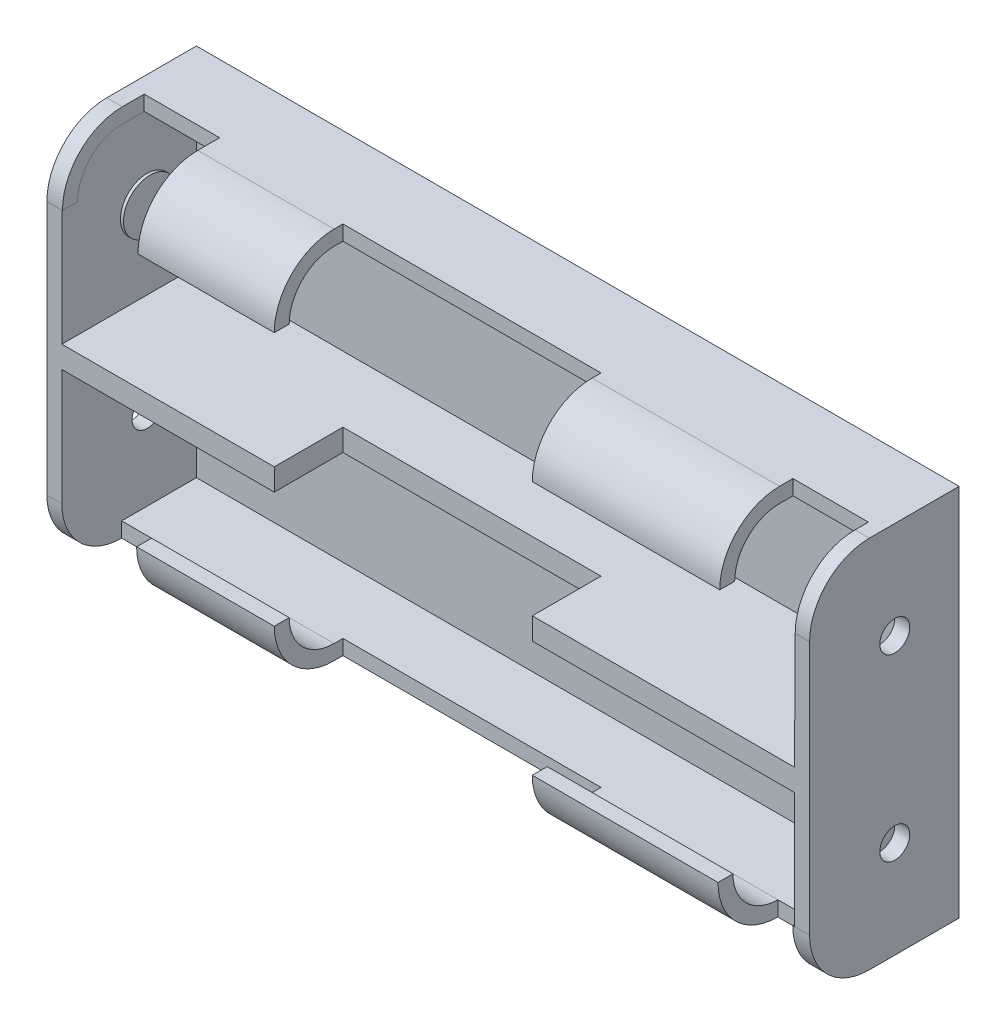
ISO-10303-21;
HEADER;
FILE_DESCRIPTION(('STEP AP214'),'2;1');
FILE_NAME('part.step','',(''),(''),'','','');
FILE_SCHEMA(('AUTOMOTIVE_DESIGN { 1 0 10303 214 1 1 1 1 }'));
ENDSEC;
DATA;
#1=APPLICATION_CONTEXT('core data for automotive mechanical design processes');
#2=APPLICATION_PROTOCOL_DEFINITION('international standard','automotive_design',2000,#1);
#3=PRODUCT_CONTEXT('',#1,'mechanical');
#4=PRODUCT('Part','Part','',(#3));
#5=PRODUCT_RELATED_PRODUCT_CATEGORY('part','',(#4));
#6=PRODUCT_DEFINITION_FORMATION('','',#4);
#7=PRODUCT_DEFINITION_CONTEXT('part definition',#1,'design');
#8=PRODUCT_DEFINITION('design','',#6,#7);
#9=PRODUCT_DEFINITION_SHAPE('','',#8);
#10=(LENGTH_UNIT() NAMED_UNIT(*) SI_UNIT(.MILLI.,.METRE.));
#11=(NAMED_UNIT(*) PLANE_ANGLE_UNIT() SI_UNIT($,.RADIAN.));
#12=(NAMED_UNIT(*) SI_UNIT($,.STERADIAN.) SOLID_ANGLE_UNIT());
#13=UNCERTAINTY_MEASURE_WITH_UNIT(LENGTH_MEASURE(1.E-05),#10,'distance_accuracy_value','');
#14=(GEOMETRIC_REPRESENTATION_CONTEXT(3) GLOBAL_UNCERTAINTY_ASSIGNED_CONTEXT((#13)) GLOBAL_UNIT_ASSIGNED_CONTEXT((#10,
#11,#12)) REPRESENTATION_CONTEXT('',''));
#15=CARTESIAN_POINT('',(0.,0.,0.));
#16=DIRECTION('',(0.,0.,1.));
#17=DIRECTION('',(1.,0.,0.));
#18=AXIS2_PLACEMENT_3D('',#15,#16,#17);
#19=CARTESIAN_POINT('',(1.24191449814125,22.8741635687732,10.));
#20=DIRECTION('',(-1.,0.,0.));
#21=DIRECTION('',(0.,-1.,0.));
#22=AXIS2_PLACEMENT_3D('',#19,#20,#21);
#23=PLANE('',#22);
#24=DIRECTION('',(0.,1.,0.));
#25=VECTOR('',#24,1.);
#26=CARTESIAN_POINT('',(1.24191449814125,22.8741635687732,10.));
#27=LINE('',#26,#25);
#28=CARTESIAN_POINT('',(1.24191449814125,1.87416356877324,10.));
#29=VERTEX_POINT('',#28);
#30=CARTESIAN_POINT('',(1.24191449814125,9.64165258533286,10.));
#31=VERTEX_POINT('',#30);
#32=EDGE_CURVE('E577',#29,#31,#27,.T.);
#33=ORIENTED_EDGE('',*,*,#32,.T.);
#34=DIRECTION('',(0.,0.,-1.));
#35=VECTOR('',#34,1.);
#36=CARTESIAN_POINT('',(1.24191449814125,9.64165258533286,10.));
#37=LINE('',#36,#35);
#38=CARTESIAN_POINT('',(1.24191449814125,9.64165258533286,1.));
#39=VERTEX_POINT('',#38);
#40=EDGE_CURVE('E550',#31,#39,#37,.T.);
#41=ORIENTED_EDGE('',*,*,#40,.T.);
#42=DIRECTION('',(0.,1.,0.));
#43=VECTOR('',#42,1.);
#44=CARTESIAN_POINT('',(1.24191449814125,22.8741635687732,0.999999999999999));
#45=LINE('',#44,#43);
#46=CARTESIAN_POINT('',(1.24191449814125,-1.12583643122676,1.));
#47=VERTEX_POINT('',#46);
#48=EDGE_CURVE('E593',#47,#39,#45,.T.);
#49=ORIENTED_EDGE('',*,*,#48,.F.);
#50=DIRECTION('',(0.,0.,-1.));
#51=VECTOR('',#50,1.);
#52=CARTESIAN_POINT('',(1.24191449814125,-1.12583643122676,10.));
#53=LINE('',#52,#51);
#54=CARTESIAN_POINT('',(1.24191449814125,-1.12583643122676,6.));
#55=VERTEX_POINT('',#54);
#56=EDGE_CURVE('E569',#55,#47,#53,.T.);
#57=ORIENTED_EDGE('',*,*,#56,.F.);
#58=CARTESIAN_POINT('',(1.24191449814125,1.87416356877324,6.));
#59=DIRECTION('',(-1.,0.,0.));
#60=DIRECTION('',(0.,-1.,0.));
#61=AXIS2_PLACEMENT_3D('',#58,#59,#60);
#62=CIRCLE('',#61,3.);
#63=CARTESIAN_POINT('',(1.24191449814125,1.87416356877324,9.));
#64=VERTEX_POINT('',#63);
#65=EDGE_CURVE('E564',#64,#55,#62,.F.);
#66=ORIENTED_EDGE('',*,*,#65,.F.);
#67=DIRECTION('',(0.,0.,1.));
#68=VECTOR('',#67,1.);
#69=CARTESIAN_POINT('',(1.24191449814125,1.87416356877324,10.));
#70=LINE('',#69,#68);
#71=EDGE_CURVE('E610',#64,#29,#70,.T.);
#72=ORIENTED_EDGE('',*,*,#71,.T.);
#73=EDGE_LOOP('',(#33,#41,#49,#57,#66,#72));
#74=FACE_BOUND('',#73,.T.);
#75=CARTESIAN_POINT('',(1.24191449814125,4.47610662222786,4.35609630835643));
#76=DIRECTION('',(-1.,0.,0.));
#77=DIRECTION('',(0.,-1.,0.));
#78=AXIS2_PLACEMENT_3D('',#75,#76,#77);
#79=CIRCLE('',#78,1.78906510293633);
#80=CARTESIAN_POINT('',(1.24191449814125,2.68704151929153,4.35609630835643));
#81=VERTEX_POINT('',#80);
#82=EDGE_CURVE('E1411',#81,#81,#79,.T.);
#83=ORIENTED_EDGE('',*,*,#82,.F.);
#84=EDGE_LOOP('',(#83));
#85=FACE_BOUND('',#84,.T.);
#86=ADVANCED_FACE('F26',(#74,#85),#23,.T.);
#87=CARTESIAN_POINT('',(-47.7580855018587,22.8741635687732,10.));
#88=DIRECTION('',(1.,0.,0.));
#89=DIRECTION('',(0.,1.,0.));
#90=AXIS2_PLACEMENT_3D('',#87,#88,#89);
#91=PLANE('',#90);
#92=DIRECTION('',(0.,-1.,0.));
#93=VECTOR('',#92,1.);
#94=CARTESIAN_POINT('',(-47.7580855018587,22.8741635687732,10.));
#95=LINE('',#94,#93);
#96=CARTESIAN_POINT('',(-47.7580855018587,18.8741635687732,10.));
#97=VERTEX_POINT('',#96);
#98=CARTESIAN_POINT('',(-47.7580855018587,11.1066745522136,10.));
#99=VERTEX_POINT('',#98);
#100=EDGE_CURVE('E623',#97,#99,#95,.T.);
#101=ORIENTED_EDGE('',*,*,#100,.T.);
#102=DIRECTION('',(0.,0.,-1.));
#103=VECTOR('',#102,1.);
#104=CARTESIAN_POINT('',(-47.7580855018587,11.1066745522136,10.));
#105=LINE('',#104,#103);
#106=CARTESIAN_POINT('',(-47.7580855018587,11.1066745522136,1.));
#107=VERTEX_POINT('',#106);
#108=EDGE_CURVE('E547',#99,#107,#105,.T.);
#109=ORIENTED_EDGE('',*,*,#108,.T.);
#110=DIRECTION('',(0.,-1.,0.));
#111=VECTOR('',#110,1.);
#112=CARTESIAN_POINT('',(-47.7580855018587,22.8741635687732,0.999999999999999));
#113=LINE('',#112,#111);
#114=CARTESIAN_POINT('',(-47.7580855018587,21.8741635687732,1.));
#115=VERTEX_POINT('',#114);
#116=EDGE_CURVE('E578',#115,#107,#113,.T.);
#117=ORIENTED_EDGE('',*,*,#116,.F.);
#118=DIRECTION('',(0.,0.,-1.));
#119=VECTOR('',#118,1.);
#120=CARTESIAN_POINT('',(-47.7580855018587,21.8741635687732,10.));
#121=LINE('',#120,#119);
#122=CARTESIAN_POINT('',(-47.7580855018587,21.8741635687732,6.));
#123=VERTEX_POINT('',#122);
#124=EDGE_CURVE('E574',#123,#115,#121,.T.);
#125=ORIENTED_EDGE('',*,*,#124,.F.);
#126=CARTESIAN_POINT('',(-47.7580855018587,18.8741635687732,6.));
#127=DIRECTION('',(1.,0.,0.));
#128=DIRECTION('',(0.,1.,0.));
#129=AXIS2_PLACEMENT_3D('',#126,#127,#128);
#130=CIRCLE('',#129,3.);
#131=CARTESIAN_POINT('',(-47.7580855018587,18.8741635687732,9.));
#132=VERTEX_POINT('',#131);
#133=EDGE_CURVE('E570',#132,#123,#130,.F.);
#134=ORIENTED_EDGE('',*,*,#133,.F.);
#135=DIRECTION('',(0.,0.,1.));
#136=VECTOR('',#135,1.);
#137=CARTESIAN_POINT('',(-47.7580855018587,18.8741635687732,10.));
#138=LINE('',#137,#136);
#139=EDGE_CURVE('E613',#132,#97,#138,.T.);
#140=ORIENTED_EDGE('',*,*,#139,.T.);
#141=EDGE_LOOP('',(#101,#109,#117,#125,#134,#140));
#142=FACE_BOUND('',#141,.T.);
#143=CARTESIAN_POINT('',(-47.7580855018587,16.3741635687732,4.30297397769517));
#144=DIRECTION('',(1.,0.,0.));
#145=DIRECTION('',(0.,1.,0.));
#146=AXIS2_PLACEMENT_3D('',#143,#144,#145);
#147=CIRCLE('',#146,1.77531814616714);
#148=CARTESIAN_POINT('',(-47.7580855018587,18.1494817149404,4.30297397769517));
#149=VERTEX_POINT('',#148);
#150=EDGE_CURVE('E1414',#149,#149,#147,.T.);
#151=ORIENTED_EDGE('',*,*,#150,.F.);
#152=EDGE_LOOP('',(#151));
#153=FACE_BOUND('',#152,.T.);
#154=ADVANCED_FACE('F735',(#142,#153),#91,.T.);
#155=CARTESIAN_POINT('',(1.28103244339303,13.8741635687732,5.10448349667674));
#156=DIRECTION('',(0.,0.,-1.));
#157=DIRECTION('',(-1.,0.,0.));
#158=AXIS2_PLACEMENT_3D('',#155,#156,#157);
#159=PLANE('',#158);
#160=DIRECTION('',(0.,1.,0.));
#161=VECTOR('',#160,1.);
#162=CARTESIAN_POINT('',(1.28103244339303,13.8741635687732,5.10448349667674));
#163=LINE('',#162,#161);
#164=CARTESIAN_POINT('',(1.28103244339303,13.8741635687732,5.10448349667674));
#165=VERTEX_POINT('',#164);
#166=CARTESIAN_POINT('',(1.28103244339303,15.7761815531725,5.10448349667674));
#167=VERTEX_POINT('',#166);
#168=EDGE_CURVE('E1047',#165,#167,#163,.T.);
#169=ORIENTED_EDGE('',*,*,#168,.T.);
#170=DIRECTION('',(-1.,0.,0.));
#171=VECTOR('',#170,1.);
#172=CARTESIAN_POINT('',(2.24191449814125,15.7761815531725,5.10448349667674));
#173=LINE('',#172,#171);
#174=CARTESIAN_POINT('',(1.24191449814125,15.7761815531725,5.10448349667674));
#175=VERTEX_POINT('',#174);
#176=EDGE_CURVE('E11',#167,#175,#173,.T.);
#177=ORIENTED_EDGE('',*,*,#176,.T.);
#178=DIRECTION('',(0.,-1.,0.));
#179=VECTOR('',#178,1.);
#180=CARTESIAN_POINT('',(1.24191449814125,22.8741635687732,5.10448349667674));
#181=LINE('',#180,#179);
#182=CARTESIAN_POINT('',(1.24191449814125,13.8741635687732,5.10448349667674));
#183=VERTEX_POINT('',#182);
#184=EDGE_CURVE('E375',#175,#183,#181,.T.);
#185=ORIENTED_EDGE('',*,*,#184,.T.);
#186=DIRECTION('',(-1.,0.,0.));
#187=VECTOR('',#186,1.);
#188=CARTESIAN_POINT('',(1.28103244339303,13.8741635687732,5.10448349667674));
#189=LINE('',#188,#187);
#190=EDGE_CURVE('E1040',#165,#183,#189,.T.);
#191=ORIENTED_EDGE('',*,*,#190,.F.);
#192=EDGE_LOOP('',(#169,#177,#185,#191));
#193=FACE_BOUND('',#192,.T.);
#194=ADVANCED_FACE('F934',(#193),#159,.F.);
#195=CARTESIAN_POINT('',(-48.7580855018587,18.8741635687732,6.));
#196=DIRECTION('',(1.,0.,0.));
#197=DIRECTION('',(0.,0.,-1.));
#198=AXIS2_PLACEMENT_3D('',#195,#196,#197);
#199=CYLINDRICAL_SURFACE('',#198,4.);
#200=CARTESIAN_POINT('',(1.28103244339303,18.8741635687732,6.));
#201=DIRECTION('',(1.,0.,0.));
#202=DIRECTION('',(0.,0.,-1.));
#203=AXIS2_PLACEMENT_3D('',#200,#201,#202);
#204=CIRCLE('',#203,4.);
#205=CARTESIAN_POINT('',(1.28103244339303,18.8741635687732,10.));
#206=VERTEX_POINT('',#205);
#207=CARTESIAN_POINT('',(1.28103244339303,22.8741635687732,6.));
#208=VERTEX_POINT('',#207);
#209=EDGE_CURVE('E713',#206,#208,#204,.F.);
#210=ORIENTED_EDGE('',*,*,#209,.F.);
#211=DIRECTION('',(-1.,0.,0.));
#212=VECTOR('',#211,1.);
#213=CARTESIAN_POINT('',(-48.7580855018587,18.8741635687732,10.));
#214=LINE('',#213,#212);
#215=CARTESIAN_POINT('',(2.24191449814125,18.8741635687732,10.));
#216=VERTEX_POINT('',#215);
#217=EDGE_CURVE('E650',#216,#206,#214,.T.);
#218=ORIENTED_EDGE('',*,*,#217,.F.);
#219=CARTESIAN_POINT('',(2.24191449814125,18.8741635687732,6.));
#220=DIRECTION('',(-1.,0.,0.));
#221=DIRECTION('',(0.,-1.,0.));
#222=AXIS2_PLACEMENT_3D('',#219,#220,#221);
#223=CIRCLE('',#222,4.);
#224=CARTESIAN_POINT('',(2.24191449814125,22.8741635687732,6.));
#225=VERTEX_POINT('',#224);
#226=EDGE_CURVE('E657',#225,#216,#223,.F.);
#227=ORIENTED_EDGE('',*,*,#226,.F.);
#228=DIRECTION('',(-1.,0.,0.));
#229=VECTOR('',#228,1.);
#230=CARTESIAN_POINT('',(2.24191449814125,22.8741635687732,6.));
#231=LINE('',#230,#229);
#232=EDGE_CURVE('E673',#208,#225,#231,.F.);
#233=ORIENTED_EDGE('',*,*,#232,.F.);
#234=EDGE_LOOP('',(#210,#218,#227,#233));
#235=FACE_BOUND('',#234,.T.);
#236=ADVANCED_FACE('F843',(#235),#199,.T.);
#237=CARTESIAN_POINT('',(-47.7158133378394,18.8741635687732,6.));
#238=DIRECTION('',(-1.,0.,0.));
#239=DIRECTION('',(0.,0.,1.));
#240=AXIS2_PLACEMENT_3D('',#237,#238,#239);
#241=CIRCLE('',#240,4.);
#242=CARTESIAN_POINT('',(-47.7158133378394,22.8741635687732,6.));
#243=VERTEX_POINT('',#242);
#244=CARTESIAN_POINT('',(-47.7158133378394,18.8741635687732,10.));
#245=VERTEX_POINT('',#244);
#246=EDGE_CURVE('E417',#243,#245,#241,.F.);
#247=ORIENTED_EDGE('',*,*,#246,.F.);
#248=CARTESIAN_POINT('',(-48.7580855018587,22.8741635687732,6.));
#249=VERTEX_POINT('',#248);
#250=EDGE_CURVE('E674',#249,#243,#231,.F.);
#251=ORIENTED_EDGE('',*,*,#250,.F.);
#252=CARTESIAN_POINT('',(-48.7580855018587,18.8741635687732,6.));
#253=DIRECTION('',(1.,0.,0.));
#254=DIRECTION('',(0.,1.,0.));
#255=AXIS2_PLACEMENT_3D('',#252,#253,#254);
#256=CIRCLE('',#255,4.);
#257=CARTESIAN_POINT('',(-48.7580855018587,18.8741635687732,10.));
#258=VERTEX_POINT('',#257);
#259=EDGE_CURVE('E666',#258,#249,#256,.F.);
#260=ORIENTED_EDGE('',*,*,#259,.F.);
#261=EDGE_CURVE('E649',#97,#258,#214,.T.);
#262=ORIENTED_EDGE('',*,*,#261,.F.);
#263=DIRECTION('',(-1.,0.,0.));
#264=VECTOR('',#263,1.);
#265=CARTESIAN_POINT('',(-48.7580855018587,18.8741635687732,10.));
#266=LINE('',#265,#264);
#267=EDGE_CURVE('E561',#245,#97,#266,.T.);
#268=ORIENTED_EDGE('',*,*,#267,.F.);
#269=EDGE_LOOP('',(#247,#251,#260,#262,#268));
#270=FACE_BOUND('',#269,.T.);
#271=ADVANCED_FACE('F802',(#270),#199,.T.);
#272=CARTESIAN_POINT('',(-48.7580855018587,18.8741635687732,10.));
#273=DIRECTION('',(0.,1.,0.));
#274=DIRECTION('',(-1.,0.,0.));
#275=AXIS2_PLACEMENT_3D('',#272,#273,#274);
#276=PLANE('',#275);
#277=DIRECTION('',(1.,0.,0.));
#278=VECTOR('',#277,1.);
#279=CARTESIAN_POINT('',(-23.2580855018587,18.8741635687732,9.));
#280=LINE('',#279,#278);
#281=CARTESIAN_POINT('',(-47.7158133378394,18.8741635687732,9.));
#282=VERTEX_POINT('',#281);
#283=EDGE_CURVE('E608',#282,#132,#280,.F.);
#284=ORIENTED_EDGE('',*,*,#283,.F.);
#285=DIRECTION('',(0.,0.,1.));
#286=VECTOR('',#285,1.);
#287=CARTESIAN_POINT('',(-47.7158133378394,18.8741635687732,10.));
#288=LINE('',#287,#286);
#289=EDGE_CURVE('E414',#282,#245,#288,.T.);
#290=ORIENTED_EDGE('',*,*,#289,.T.);
#291=ORIENTED_EDGE('',*,*,#267,.T.);
#292=ORIENTED_EDGE('',*,*,#139,.F.);
#293=EDGE_LOOP('',(#284,#290,#291,#292));
#294=FACE_BOUND('',#293,.T.);
#295=ADVANCED_FACE('F808',(#294),#276,.F.);
#296=CARTESIAN_POINT('',(-48.7580855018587,18.8741635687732,6.));
#297=DIRECTION('',(1.,0.,0.));
#298=DIRECTION('',(0.,0.,-1.));
#299=AXIS2_PLACEMENT_3D('',#296,#297,#298);
#300=CYLINDRICAL_SURFACE('',#299,3.);
#301=DIRECTION('',(1.,0.,0.));
#302=VECTOR('',#301,1.);
#303=CARTESIAN_POINT('',(-48.7580855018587,21.8741635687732,6.));
#304=LINE('',#303,#302);
#305=CARTESIAN_POINT('',(-47.7158133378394,21.8741635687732,6.));
#306=VERTEX_POINT('',#305);
#307=EDGE_CURVE('E598',#123,#306,#304,.T.);
#308=ORIENTED_EDGE('',*,*,#307,.T.);
#309=CARTESIAN_POINT('',(-47.7158133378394,18.8741635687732,6.));
#310=DIRECTION('',(-1.,0.,0.));
#311=DIRECTION('',(0.,0.,1.));
#312=AXIS2_PLACEMENT_3D('',#309,#310,#311);
#313=CIRCLE('',#312,3.);
#314=EDGE_CURVE('E411',#306,#282,#313,.F.);
#315=ORIENTED_EDGE('',*,*,#314,.T.);
#316=ORIENTED_EDGE('',*,*,#283,.T.);
#317=ORIENTED_EDGE('',*,*,#133,.T.);
#318=EDGE_LOOP('',(#308,#315,#316,#317));
#319=FACE_BOUND('',#318,.T.);
#320=ADVANCED_FACE('F952',(#319),#300,.F.);
#321=CARTESIAN_POINT('',(-48.7580855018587,1.87416356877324,6.));
#322=DIRECTION('',(-1.,0.,0.));
#323=DIRECTION('',(0.,0.,1.));
#324=AXIS2_PLACEMENT_3D('',#321,#322,#323);
#325=CYLINDRICAL_SURFACE('',#324,4.);
#326=CARTESIAN_POINT('',(1.11825222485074,1.87416356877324,6.));
#327=DIRECTION('',(1.,0.,0.));
#328=DIRECTION('',(0.,0.,-1.));
#329=AXIS2_PLACEMENT_3D('',#326,#327,#328);
#330=CIRCLE('',#329,4.);
#331=CARTESIAN_POINT('',(1.11825222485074,-2.12583643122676,6.));
#332=VERTEX_POINT('',#331);
#333=CARTESIAN_POINT('',(1.11825222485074,1.87416356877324,10.));
#334=VERTEX_POINT('',#333);
#335=EDGE_CURVE('E435',#332,#334,#330,.F.);
#336=ORIENTED_EDGE('',*,*,#335,.F.);
#337=DIRECTION('',(1.,0.,0.));
#338=VECTOR('',#337,1.);
#339=CARTESIAN_POINT('',(-48.7580855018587,-2.12583643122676,6.));
#340=LINE('',#339,#338);
#341=CARTESIAN_POINT('',(2.24191449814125,-2.12583643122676,6.));
#342=VERTEX_POINT('',#341);
#343=EDGE_CURVE('E663',#342,#332,#340,.F.);
#344=ORIENTED_EDGE('',*,*,#343,.F.);
#345=CARTESIAN_POINT('',(2.24191449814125,1.87416356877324,6.));
#346=DIRECTION('',(-1.,0.,0.));
#347=DIRECTION('',(0.,-1.,0.));
#348=AXIS2_PLACEMENT_3D('',#345,#346,#347);
#349=CIRCLE('',#348,4.);
#350=CARTESIAN_POINT('',(2.24191449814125,1.87416356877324,10.));
#351=VERTEX_POINT('',#350);
#352=EDGE_CURVE('E660',#351,#342,#349,.F.);
#353=ORIENTED_EDGE('',*,*,#352,.F.);
#354=DIRECTION('',(1.,0.,0.));
#355=VECTOR('',#354,1.);
#356=CARTESIAN_POINT('',(2.24191449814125,1.87416356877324,10.));
#357=LINE('',#356,#355);
#358=EDGE_CURVE('E653',#29,#351,#357,.T.);
#359=ORIENTED_EDGE('',*,*,#358,.F.);
#360=DIRECTION('',(1.,0.,0.));
#361=VECTOR('',#360,1.);
#362=CARTESIAN_POINT('',(2.24191449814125,1.87416356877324,10.));
#363=LINE('',#362,#361);
#364=EDGE_CURVE('E559',#334,#29,#363,.T.);
#365=ORIENTED_EDGE('',*,*,#364,.F.);
#366=EDGE_LOOP('',(#336,#344,#353,#359,#365));
#367=FACE_BOUND('',#366,.T.);
#368=ADVANCED_FACE('F851',(#367),#325,.T.);
#369=CARTESIAN_POINT('',(2.24191449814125,1.87416356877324,10.));
#370=DIRECTION('',(0.,-1.,0.));
#371=DIRECTION('',(1.,0.,0.));
#372=AXIS2_PLACEMENT_3D('',#369,#370,#371);
#373=PLANE('',#372);
#374=DIRECTION('',(-1.,0.,0.));
#375=VECTOR('',#374,1.);
#376=CARTESIAN_POINT('',(-23.2580855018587,1.87416356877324,9.));
#377=LINE('',#376,#375);
#378=CARTESIAN_POINT('',(1.11825222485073,1.87416356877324,9.));
#379=VERTEX_POINT('',#378);
#380=EDGE_CURVE('E601',#379,#64,#377,.F.);
#381=ORIENTED_EDGE('',*,*,#380,.F.);
#382=DIRECTION('',(0.,0.,1.));
#383=VECTOR('',#382,1.);
#384=CARTESIAN_POINT('',(1.11825222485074,1.87416356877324,10.));
#385=LINE('',#384,#383);
#386=EDGE_CURVE('E432',#379,#334,#385,.T.);
#387=ORIENTED_EDGE('',*,*,#386,.T.);
#388=ORIENTED_EDGE('',*,*,#364,.T.);
#389=ORIENTED_EDGE('',*,*,#71,.F.);
#390=EDGE_LOOP('',(#381,#387,#388,#389));
#391=FACE_BOUND('',#390,.T.);
#392=ADVANCED_FACE('F858',(#391),#373,.F.);
#393=CARTESIAN_POINT('',(-48.7580855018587,1.87416356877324,6.));
#394=DIRECTION('',(-1.,0.,0.));
#395=DIRECTION('',(0.,0.,1.));
#396=AXIS2_PLACEMENT_3D('',#393,#394,#395);
#397=CYLINDRICAL_SURFACE('',#396,3.);
#398=DIRECTION('',(1.,0.,0.));
#399=VECTOR('',#398,1.);
#400=CARTESIAN_POINT('',(-48.7580855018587,-1.12583643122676,6.));
#401=LINE('',#400,#399);
#402=CARTESIAN_POINT('',(1.11825222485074,-1.12583643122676,6.));
#403=VERTEX_POINT('',#402);
#404=EDGE_CURVE('E573',#55,#403,#401,.F.);
#405=ORIENTED_EDGE('',*,*,#404,.T.);
#406=CARTESIAN_POINT('',(1.11825222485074,1.87416356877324,6.));
#407=DIRECTION('',(1.,0.,0.));
#408=DIRECTION('',(0.,0.,-1.));
#409=AXIS2_PLACEMENT_3D('',#406,#407,#408);
#410=CIRCLE('',#409,3.);
#411=EDGE_CURVE('E700',#403,#379,#410,.F.);
#412=ORIENTED_EDGE('',*,*,#411,.T.);
#413=ORIENTED_EDGE('',*,*,#380,.T.);
#414=ORIENTED_EDGE('',*,*,#65,.T.);
#415=EDGE_LOOP('',(#405,#412,#413,#414));
#416=FACE_BOUND('',#415,.T.);
#417=ADVANCED_FACE('F907',(#416),#397,.F.);
#418=CARTESIAN_POINT('',(-47.7580855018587,1.87416356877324,6.));
#419=DIRECTION('',(-1.,0.,0.));
#420=DIRECTION('',(0.,0.,1.));
#421=AXIS2_PLACEMENT_3D('',#418,#419,#420);
#422=CIRCLE('',#421,4.);
#423=CARTESIAN_POINT('',(-47.7580855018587,1.87416356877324,10.));
#424=VERTEX_POINT('',#423);
#425=CARTESIAN_POINT('',(-47.7580855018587,-2.12583643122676,6.));
#426=VERTEX_POINT('',#425);
#427=EDGE_CURVE('E450',#424,#426,#422,.F.);
#428=ORIENTED_EDGE('',*,*,#427,.F.);
#429=CARTESIAN_POINT('',(-48.7580855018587,1.87416356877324,10.));
#430=VERTEX_POINT('',#429);
#431=EDGE_CURVE('E654',#430,#424,#357,.T.);
#432=ORIENTED_EDGE('',*,*,#431,.F.);
#433=CARTESIAN_POINT('',(-48.7580855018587,1.87416356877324,6.));
#434=DIRECTION('',(1.,0.,0.));
#435=DIRECTION('',(0.,1.,0.));
#436=AXIS2_PLACEMENT_3D('',#433,#434,#435);
#437=CIRCLE('',#436,4.);
#438=CARTESIAN_POINT('',(-48.7580855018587,-2.12583643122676,6.));
#439=VERTEX_POINT('',#438);
#440=EDGE_CURVE('E670',#439,#430,#437,.F.);
#441=ORIENTED_EDGE('',*,*,#440,.F.);
#442=EDGE_CURVE('E662',#426,#439,#340,.F.);
#443=ORIENTED_EDGE('',*,*,#442,.F.);
#444=EDGE_LOOP('',(#428,#432,#441,#443));
#445=FACE_BOUND('',#444,.T.);
#446=ADVANCED_FACE('F791',(#445),#325,.T.);
#447=CARTESIAN_POINT('',(-48.7580855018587,-2.12583643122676,10.));
#448=DIRECTION('',(0.,0.,1.));
#449=DIRECTION('',(1.,0.,0.));
#450=AXIS2_PLACEMENT_3D('',#447,#448,#449);
#451=PLANE('',#450);
#452=DIRECTION('',(0.,-1.,0.));
#453=VECTOR('',#452,1.);
#454=CARTESIAN_POINT('',(-33.5539343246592,-2.12583643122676,10.));
#455=LINE('',#454,#453);
#456=CARTESIAN_POINT('',(-33.5539343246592,11.1066745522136,10.));
#457=VERTEX_POINT('',#456);
#458=CARTESIAN_POINT('',(-33.5539343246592,9.64165258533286,10.));
#459=VERTEX_POINT('',#458);
#460=EDGE_CURVE('E511',#457,#459,#455,.T.);
#461=ORIENTED_EDGE('',*,*,#460,.F.);
#462=DIRECTION('',(-1.,0.,0.));
#463=VECTOR('',#462,1.);
#464=CARTESIAN_POINT('',(-48.7580855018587,11.1066745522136,10.));
#465=LINE('',#464,#463);
#466=EDGE_CURVE('E540',#457,#99,#465,.T.);
#467=ORIENTED_EDGE('',*,*,#466,.T.);
#468=ORIENTED_EDGE('',*,*,#100,.F.);
#469=ORIENTED_EDGE('',*,*,#261,.T.);
#470=DIRECTION('',(0.,-1.,0.));
#471=VECTOR('',#470,1.);
#472=CARTESIAN_POINT('',(-48.7580855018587,22.8741635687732,10.));
#473=LINE('',#472,#471);
#474=EDGE_CURVE('E637',#258,#430,#473,.T.);
#475=ORIENTED_EDGE('',*,*,#474,.T.);
#476=ORIENTED_EDGE('',*,*,#431,.T.);
#477=CARTESIAN_POINT('',(-47.7580855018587,9.64165258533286,10.));
#478=VERTEX_POINT('',#477);
#479=EDGE_CURVE('E605',#478,#424,#95,.T.);
#480=ORIENTED_EDGE('',*,*,#479,.F.);
#481=DIRECTION('',(1.,0.,0.));
#482=VECTOR('',#481,1.);
#483=CARTESIAN_POINT('',(-48.7580855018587,9.64165258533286,10.));
#484=LINE('',#483,#482);
#485=EDGE_CURVE('E537',#478,#459,#484,.T.);
#486=ORIENTED_EDGE('',*,*,#485,.T.);
#487=EDGE_LOOP('',(#461,#467,#468,#469,#475,#476,#480,#486));
#488=FACE_BOUND('',#487,.T.);
#489=ADVANCED_FACE('F742',(#488),#451,.T.);
#490=CARTESIAN_POINT('',(-42.7580855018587,1.87416356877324,6.));
#491=DIRECTION('',(1.,0.,0.));
#492=DIRECTION('',(0.,0.,-1.));
#493=AXIS2_PLACEMENT_3D('',#490,#491,#492);
#494=CIRCLE('',#493,4.);
#495=CARTESIAN_POINT('',(-42.7580855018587,-2.12583643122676,6.));
#496=VERTEX_POINT('',#495);
#497=CARTESIAN_POINT('',(-42.7580855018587,1.87416356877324,10.));
#498=VERTEX_POINT('',#497);
#499=EDGE_CURVE('E448',#496,#498,#494,.F.);
#500=ORIENTED_EDGE('',*,*,#499,.F.);
#501=CARTESIAN_POINT('',(-33.5539343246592,-2.12583643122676,6.));
#502=VERTEX_POINT('',#501);
#503=EDGE_CURVE('E668',#502,#496,#340,.F.);
#504=ORIENTED_EDGE('',*,*,#503,.F.);
#505=CARTESIAN_POINT('',(-33.5539343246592,1.87416356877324,6.));
#506=DIRECTION('',(-1.,0.,0.));
#507=DIRECTION('',(0.,0.,1.));
#508=AXIS2_PLACEMENT_3D('',#505,#506,#507);
#509=CIRCLE('',#508,4.);
#510=CARTESIAN_POINT('',(-33.5539343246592,1.87416356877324,10.));
#511=VERTEX_POINT('',#510);
#512=EDGE_CURVE('E534',#511,#502,#509,.F.);
#513=ORIENTED_EDGE('',*,*,#512,.F.);
#514=EDGE_CURVE('E562',#498,#511,#363,.T.);
#515=ORIENTED_EDGE('',*,*,#514,.F.);
#516=EDGE_LOOP('',(#500,#504,#513,#515));
#517=FACE_BOUND('',#516,.T.);
#518=ADVANCED_FACE('F887',(#517),#325,.T.);
#519=CARTESIAN_POINT('',(-42.6696265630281,18.8741635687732,6.));
#520=DIRECTION('',(1.,0.,0.));
#521=DIRECTION('',(0.,0.,-1.));
#522=AXIS2_PLACEMENT_3D('',#519,#520,#521);
#523=CIRCLE('',#522,4.);
#524=CARTESIAN_POINT('',(-42.6696265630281,18.8741635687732,10.));
#525=VERTEX_POINT('',#524);
#526=CARTESIAN_POINT('',(-42.6696265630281,22.8741635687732,6.));
#527=VERTEX_POINT('',#526);
#528=EDGE_CURVE('E409',#525,#527,#523,.F.);
#529=ORIENTED_EDGE('',*,*,#528,.F.);
#530=CARTESIAN_POINT('',(-33.5539343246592,18.8741635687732,10.));
#531=VERTEX_POINT('',#530);
#532=EDGE_CURVE('E560',#531,#525,#266,.T.);
#533=ORIENTED_EDGE('',*,*,#532,.F.);
#534=CARTESIAN_POINT('',(-33.5539343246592,18.8741635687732,6.));
#535=DIRECTION('',(-1.,0.,0.));
#536=DIRECTION('',(0.,0.,1.));
#537=AXIS2_PLACEMENT_3D('',#534,#535,#536);
#538=CIRCLE('',#537,4.);
#539=CARTESIAN_POINT('',(-33.5539343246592,22.8741635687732,6.));
#540=VERTEX_POINT('',#539);
#541=EDGE_CURVE('E524',#540,#531,#538,.F.);
#542=ORIENTED_EDGE('',*,*,#541,.F.);
#543=EDGE_CURVE('E678',#527,#540,#231,.F.);
#544=ORIENTED_EDGE('',*,*,#543,.F.);
#545=EDGE_LOOP('',(#529,#533,#542,#544));
#546=FACE_BOUND('',#545,.T.);
#547=ADVANCED_FACE('F827',(#546),#199,.T.);
#548=ORIENTED_EDGE('',*,*,#532,.T.);
#549=DIRECTION('',(0.,0.,-1.));
#550=VECTOR('',#549,1.);
#551=CARTESIAN_POINT('',(-42.6696265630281,18.8741635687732,10.));
#552=LINE('',#551,#550);
#553=CARTESIAN_POINT('',(-42.6696265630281,18.8741635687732,9.));
#554=VERTEX_POINT('',#553);
#555=EDGE_CURVE('E406',#525,#554,#552,.T.);
#556=ORIENTED_EDGE('',*,*,#555,.T.);
#557=CARTESIAN_POINT('',(-33.5539343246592,18.8741635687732,9.));
#558=VERTEX_POINT('',#557);
#559=EDGE_CURVE('E619',#558,#554,#280,.F.);
#560=ORIENTED_EDGE('',*,*,#559,.F.);
#561=DIRECTION('',(0.,0.,1.));
#562=VECTOR('',#561,1.);
#563=CARTESIAN_POINT('',(-33.5539343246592,18.8741635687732,10.));
#564=LINE('',#563,#562);
#565=EDGE_CURVE('E521',#558,#531,#564,.T.);
#566=ORIENTED_EDGE('',*,*,#565,.T.);
#567=EDGE_LOOP('',(#548,#556,#560,#566));
#568=FACE_BOUND('',#567,.T.);
#569=ADVANCED_FACE('F819',(#568),#276,.F.);
#570=CARTESIAN_POINT('',(-42.7580855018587,1.87416356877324,9.));
#571=VERTEX_POINT('',#570);
#572=CARTESIAN_POINT('',(-33.5539343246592,1.87416356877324,9.));
#573=VERTEX_POINT('',#572);
#574=EDGE_CURVE('E606',#571,#573,#377,.F.);
#575=ORIENTED_EDGE('',*,*,#574,.F.);
#576=DIRECTION('',(0.,0.,1.));
#577=VECTOR('',#576,1.);
#578=CARTESIAN_POINT('',(-42.7580855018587,1.87416356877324,10.));
#579=LINE('',#578,#577);
#580=EDGE_CURVE('E443',#571,#498,#579,.T.);
#581=ORIENTED_EDGE('',*,*,#580,.T.);
#582=ORIENTED_EDGE('',*,*,#514,.T.);
#583=DIRECTION('',(0.,0.,-1.));
#584=VECTOR('',#583,1.);
#585=CARTESIAN_POINT('',(-33.5539343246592,1.87416356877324,10.));
#586=LINE('',#585,#584);
#587=EDGE_CURVE('E531',#511,#573,#586,.T.);
#588=ORIENTED_EDGE('',*,*,#587,.T.);
#589=EDGE_LOOP('',(#575,#581,#582,#588));
#590=FACE_BOUND('',#589,.T.);
#591=ADVANCED_FACE('F894',(#590),#373,.F.);
#592=CARTESIAN_POINT('',(-33.5539343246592,-1.12583643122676,6.));
#593=VERTEX_POINT('',#592);
#594=CARTESIAN_POINT('',(-42.7580855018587,-1.12583643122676,6.));
#595=VERTEX_POINT('',#594);
#596=EDGE_CURVE('E587',#593,#595,#401,.F.);
#597=ORIENTED_EDGE('',*,*,#596,.T.);
#598=CARTESIAN_POINT('',(-42.7580855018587,1.87416356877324,6.));
#599=DIRECTION('',(1.,0.,0.));
#600=DIRECTION('',(0.,0.,-1.));
#601=AXIS2_PLACEMENT_3D('',#598,#599,#600);
#602=CIRCLE('',#601,3.);
#603=EDGE_CURVE('E694',#595,#571,#602,.F.);
#604=ORIENTED_EDGE('',*,*,#603,.T.);
#605=ORIENTED_EDGE('',*,*,#574,.T.);
#606=CARTESIAN_POINT('',(-33.5539343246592,1.87416356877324,6.));
#607=DIRECTION('',(-1.,0.,0.));
#608=DIRECTION('',(0.,0.,1.));
#609=AXIS2_PLACEMENT_3D('',#606,#607,#608);
#610=CIRCLE('',#609,3.);
#611=EDGE_CURVE('E526',#573,#593,#610,.F.);
#612=ORIENTED_EDGE('',*,*,#611,.T.);
#613=EDGE_LOOP('',(#597,#604,#605,#612));
#614=FACE_BOUND('',#613,.T.);
#615=ADVANCED_FACE('F897',(#614),#397,.F.);
#616=ORIENTED_EDGE('',*,*,#559,.T.);
#617=CARTESIAN_POINT('',(-42.6696265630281,18.8741635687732,6.));
#618=DIRECTION('',(1.,0.,0.));
#619=DIRECTION('',(0.,0.,-1.));
#620=AXIS2_PLACEMENT_3D('',#617,#618,#619);
#621=CIRCLE('',#620,3.);
#622=CARTESIAN_POINT('',(-42.6696265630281,21.8741635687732,6.));
#623=VERTEX_POINT('',#622);
#624=EDGE_CURVE('E402',#554,#623,#621,.F.);
#625=ORIENTED_EDGE('',*,*,#624,.T.);
#626=CARTESIAN_POINT('',(-33.5539343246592,21.8741635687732,6.));
#627=VERTEX_POINT('',#626);
#628=EDGE_CURVE('E602',#623,#627,#304,.T.);
#629=ORIENTED_EDGE('',*,*,#628,.T.);
#630=CARTESIAN_POINT('',(-33.5539343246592,18.8741635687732,6.));
#631=DIRECTION('',(-1.,0.,0.));
#632=DIRECTION('',(0.,0.,1.));
#633=AXIS2_PLACEMENT_3D('',#630,#631,#632);
#634=CIRCLE('',#633,3.);
#635=EDGE_CURVE('E516',#627,#558,#634,.F.);
#636=ORIENTED_EDGE('',*,*,#635,.T.);
#637=EDGE_LOOP('',(#616,#625,#629,#636));
#638=FACE_BOUND('',#637,.T.);
#639=ADVANCED_FACE('F814',(#638),#300,.F.);
#640=CARTESIAN_POINT('',(-47.7580855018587,4.37416356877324,4.30297397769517));
#641=DIRECTION('',(1.,0.,0.));
#642=DIRECTION('',(0.,1.,0.));
#643=AXIS2_PLACEMENT_3D('',#640,#641,#642);
#644=CIRCLE('',#643,1.);
#645=CARTESIAN_POINT('',(-47.7580855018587,5.37416356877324,4.30297397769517));
#646=VERTEX_POINT('',#645);
#647=EDGE_CURVE('E1022',#646,#646,#644,.T.);
#648=ORIENTED_EDGE('',*,*,#647,.F.);
#649=EDGE_LOOP('',(#648));
#650=FACE_BOUND('',#649,.T.);
#651=ORIENTED_EDGE('',*,*,#479,.T.);
#652=ORIENTED_EDGE('',*,*,#427,.T.);
#653=DIRECTION('',(0.,-1.,0.));
#654=VECTOR('',#653,1.);
#655=CARTESIAN_POINT('',(-47.7580855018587,6.87416356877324,6.));
#656=LINE('',#655,#654);
#657=CARTESIAN_POINT('',(-47.7580855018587,-1.12583643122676,6.));
#658=VERTEX_POINT('',#657);
#659=EDGE_CURVE('E440',#658,#426,#656,.T.);
#660=ORIENTED_EDGE('',*,*,#659,.F.);
#661=DIRECTION('',(0.,0.,-1.));
#662=VECTOR('',#661,1.);
#663=CARTESIAN_POINT('',(-47.7580855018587,-1.12583643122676,10.));
#664=LINE('',#663,#662);
#665=CARTESIAN_POINT('',(-47.7580855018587,-1.12583643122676,1.));
#666=VERTEX_POINT('',#665);
#667=EDGE_CURVE('E566',#658,#666,#664,.T.);
#668=ORIENTED_EDGE('',*,*,#667,.T.);
#669=CARTESIAN_POINT('',(-47.7580855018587,9.64165258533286,1.));
#670=VERTEX_POINT('',#669);
#671=EDGE_CURVE('E556',#670,#666,#113,.T.);
#672=ORIENTED_EDGE('',*,*,#671,.F.);
#673=DIRECTION('',(0.,0.,1.));
#674=VECTOR('',#673,1.);
#675=CARTESIAN_POINT('',(-47.7580855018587,9.64165258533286,10.));
#676=LINE('',#675,#674);
#677=EDGE_CURVE('E553',#670,#478,#676,.T.);
#678=ORIENTED_EDGE('',*,*,#677,.T.);
#679=EDGE_LOOP('',(#651,#652,#660,#668,#672,#678));
#680=FACE_BOUND('',#679,.T.);
#681=ADVANCED_FACE('F916',(#650,#680),#91,.T.);
#682=CARTESIAN_POINT('',(1.24191449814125,16.3741635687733,4.30297397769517));
#683=DIRECTION('',(-1.,0.,0.));
#684=DIRECTION('',(0.,-1.,0.));
#685=AXIS2_PLACEMENT_3D('',#682,#683,#684);
#686=CIRCLE('',#685,1.);
#687=CARTESIAN_POINT('',(1.24191449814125,16.972145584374,5.10448349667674));
#688=VERTEX_POINT('',#687);
#689=EDGE_CURVE('E363',#688,#175,#686,.T.);
#690=ORIENTED_EDGE('',*,*,#689,.F.);
#691=CARTESIAN_POINT('',(1.24191449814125,21.8741635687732,5.10448349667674));
#692=VERTEX_POINT('',#691);
#693=EDGE_CURVE('E372',#692,#688,#181,.T.);
#694=ORIENTED_EDGE('',*,*,#693,.F.);
#695=DIRECTION('',(0.,0.,-1.));
#696=VECTOR('',#695,1.);
#697=CARTESIAN_POINT('',(1.24191449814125,21.8741635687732,10.));
#698=LINE('',#697,#696);
#699=CARTESIAN_POINT('',(1.24191449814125,21.8741635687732,1.));
#700=VERTEX_POINT('',#699);
#701=EDGE_CURVE('E576',#692,#700,#698,.T.);
#702=ORIENTED_EDGE('',*,*,#701,.T.);
#703=CARTESIAN_POINT('',(1.24191449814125,11.1066745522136,0.999999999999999));
#704=VERTEX_POINT('',#703);
#705=EDGE_CURVE('E590',#704,#700,#45,.T.);
#706=ORIENTED_EDGE('',*,*,#705,.F.);
#707=DIRECTION('',(0.,0.,1.));
#708=VECTOR('',#707,1.);
#709=CARTESIAN_POINT('',(1.24191449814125,11.1066745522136,10.));
#710=LINE('',#709,#708);
#711=CARTESIAN_POINT('',(1.24191449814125,11.1066745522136,10.));
#712=VERTEX_POINT('',#711);
#713=EDGE_CURVE('E544',#704,#712,#710,.T.);
#714=ORIENTED_EDGE('',*,*,#713,.T.);
#715=CARTESIAN_POINT('',(1.24191449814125,13.8741635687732,10.));
#716=VERTEX_POINT('',#715);
#717=EDGE_CURVE('E617',#712,#716,#27,.T.);
#718=ORIENTED_EDGE('',*,*,#717,.T.);
#719=DIRECTION('',(0.,0.,-1.));
#720=VECTOR('',#719,1.);
#721=CARTESIAN_POINT('',(1.24191449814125,13.8741635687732,10.));
#722=LINE('',#721,#720);
#723=EDGE_CURVE('E384',#716,#183,#722,.T.);
#724=ORIENTED_EDGE('',*,*,#723,.T.);
#725=ORIENTED_EDGE('',*,*,#184,.F.);
#726=EDGE_LOOP('',(#690,#694,#702,#706,#714,#718,#724,#725));
#727=FACE_BOUND('',#726,.T.);
#728=ADVANCED_FACE('F371',(#727),#23,.T.);
#729=CARTESIAN_POINT('',(-48.7580855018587,-2.12583643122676,1.));
#730=DIRECTION('',(0.,0.,1.));
#731=DIRECTION('',(1.,0.,0.));
#732=AXIS2_PLACEMENT_3D('',#729,#730,#731);
#733=PLANE('',#732);
#734=ORIENTED_EDGE('',*,*,#48,.T.);
#735=DIRECTION('',(-1.,0.,0.));
#736=VECTOR('',#735,1.);
#737=CARTESIAN_POINT('',(-48.7580855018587,9.64165258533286,1.));
#738=LINE('',#737,#736);
#739=EDGE_CURVE('E682',#39,#670,#738,.T.);
#740=ORIENTED_EDGE('',*,*,#739,.T.);
#741=ORIENTED_EDGE('',*,*,#671,.T.);
#742=DIRECTION('',(1.,0.,0.));
#743=VECTOR('',#742,1.);
#744=CARTESIAN_POINT('',(-48.7580855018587,-1.12583643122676,0.999999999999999));
#745=LINE('',#744,#743);
#746=EDGE_CURVE('E581',#666,#47,#745,.T.);
#747=ORIENTED_EDGE('',*,*,#746,.T.);
#748=EDGE_LOOP('',(#734,#740,#741,#747));
#749=FACE_BOUND('',#748,.T.);
#750=ADVANCED_FACE('F913',(#749),#733,.T.);
#751=ORIENTED_EDGE('',*,*,#116,.T.);
#752=DIRECTION('',(1.,0.,0.));
#753=VECTOR('',#752,1.);
#754=CARTESIAN_POINT('',(-48.7580855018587,11.1066745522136,1.));
#755=LINE('',#754,#753);
#756=EDGE_CURVE('E677',#107,#704,#755,.T.);
#757=ORIENTED_EDGE('',*,*,#756,.T.);
#758=ORIENTED_EDGE('',*,*,#705,.T.);
#759=DIRECTION('',(-1.,0.,0.));
#760=VECTOR('',#759,1.);
#761=CARTESIAN_POINT('',(-48.7580855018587,21.8741635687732,0.999999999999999));
#762=LINE('',#761,#760);
#763=EDGE_CURVE('E596',#700,#115,#762,.T.);
#764=ORIENTED_EDGE('',*,*,#763,.T.);
#765=EDGE_LOOP('',(#751,#757,#758,#764));
#766=FACE_BOUND('',#765,.T.);
#767=ADVANCED_FACE('F730',(#766),#733,.T.);
#768=CARTESIAN_POINT('',(-48.7580855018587,22.8741635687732,10.));
#769=DIRECTION('',(1.,0.,0.));
#770=DIRECTION('',(0.,1.,0.));
#771=AXIS2_PLACEMENT_3D('',#768,#769,#770);
#772=PLANE('',#771);
#773=CARTESIAN_POINT('',(-48.7580855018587,4.37416356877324,4.30297397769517));
#774=DIRECTION('',(-1.,0.,0.));
#775=DIRECTION('',(0.,-1.,0.));
#776=AXIS2_PLACEMENT_3D('',#773,#774,#775);
#777=CIRCLE('',#776,1.);
#778=CARTESIAN_POINT('',(-48.7580855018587,3.37416356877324,4.30297397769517));
#779=VERTEX_POINT('',#778);
#780=EDGE_CURVE('E1016',#779,#779,#777,.T.);
#781=ORIENTED_EDGE('',*,*,#780,.F.);
#782=EDGE_LOOP('',(#781));
#783=FACE_BOUND('',#782,.T.);
#784=CARTESIAN_POINT('',(-48.7580855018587,16.3741635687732,4.30297397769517));
#785=DIRECTION('',(-1.,0.,0.));
#786=DIRECTION('',(0.,-1.,0.));
#787=AXIS2_PLACEMENT_3D('',#784,#785,#786);
#788=CIRCLE('',#787,1.);
#789=CARTESIAN_POINT('',(-48.7580855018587,15.3741635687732,4.30297397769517));
#790=VERTEX_POINT('',#789);
#791=EDGE_CURVE('E1019',#790,#790,#788,.T.);
#792=ORIENTED_EDGE('',*,*,#791,.F.);
#793=EDGE_LOOP('',(#792));
#794=FACE_BOUND('',#793,.T.);
#795=ORIENTED_EDGE('',*,*,#440,.T.);
#796=ORIENTED_EDGE('',*,*,#474,.F.);
#797=ORIENTED_EDGE('',*,*,#259,.T.);
#798=DIRECTION('',(0.,0.,-1.));
#799=VECTOR('',#798,1.);
#800=CARTESIAN_POINT('',(-48.7580855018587,22.8741635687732,10.));
#801=LINE('',#800,#799);
#802=CARTESIAN_POINT('',(-48.7580855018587,22.8741635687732,0.));
#803=VERTEX_POINT('',#802);
#804=EDGE_CURVE('E641',#249,#803,#801,.T.);
#805=ORIENTED_EDGE('',*,*,#804,.T.);
#806=DIRECTION('',(0.,-1.,0.));
#807=VECTOR('',#806,1.);
#808=CARTESIAN_POINT('',(-48.7580855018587,22.8741635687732,0.));
#809=LINE('',#808,#807);
#810=CARTESIAN_POINT('',(-48.7580855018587,-2.12583643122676,0.));
#811=VERTEX_POINT('',#810);
#812=EDGE_CURVE('E622',#803,#811,#809,.T.);
#813=ORIENTED_EDGE('',*,*,#812,.T.);
#814=DIRECTION('',(0.,0.,-1.));
#815=VECTOR('',#814,1.);
#816=CARTESIAN_POINT('',(-48.7580855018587,-2.12583643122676,10.));
#817=LINE('',#816,#815);
#818=EDGE_CURVE('E647',#439,#811,#817,.T.);
#819=ORIENTED_EDGE('',*,*,#818,.F.);
#820=EDGE_LOOP('',(#795,#796,#797,#805,#813,#819));
#821=FACE_BOUND('',#820,.T.);
#822=ADVANCED_FACE('F28',(#783,#794,#821),#772,.F.);
#823=CARTESIAN_POINT('',(-48.7580855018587,-2.12583643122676,10.));
#824=DIRECTION('',(0.,1.,0.));
#825=DIRECTION('',(0.,0.,1.));
#826=AXIS2_PLACEMENT_3D('',#823,#824,#825);
#827=PLANE('',#826);
#828=DIRECTION('',(1.,0.,0.));
#829=VECTOR('',#828,1.);
#830=CARTESIAN_POINT('',(-33.5539343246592,-2.12583643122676,5.40695054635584));
#831=LINE('',#830,#829);
#832=CARTESIAN_POINT('',(-33.5539343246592,-2.12583643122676,5.40695054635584));
#833=VERTEX_POINT('',#832);
#834=CARTESIAN_POINT('',(-16.2992311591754,-2.12583643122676,5.40695054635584));
#835=VERTEX_POINT('',#834);
#836=EDGE_CURVE('E454',#833,#835,#831,.T.);
#837=ORIENTED_EDGE('',*,*,#836,.F.);
#838=DIRECTION('',(0.,0.,-1.));
#839=VECTOR('',#838,1.);
#840=CARTESIAN_POINT('',(-33.5539343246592,-2.12583643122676,10.6159175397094));
#841=LINE('',#840,#839);
#842=EDGE_CURVE('E452',#502,#833,#841,.T.);
#843=ORIENTED_EDGE('',*,*,#842,.F.);
#844=ORIENTED_EDGE('',*,*,#503,.T.);
#845=DIRECTION('',(1.,0.,0.));
#846=VECTOR('',#845,1.);
#847=CARTESIAN_POINT('',(-47.7580855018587,-2.12583643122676,6.));
#848=LINE('',#847,#846);
#849=EDGE_CURVE('E437',#426,#496,#848,.T.);
#850=ORIENTED_EDGE('',*,*,#849,.F.);
#851=ORIENTED_EDGE('',*,*,#442,.T.);
#852=ORIENTED_EDGE('',*,*,#818,.T.);
#853=DIRECTION('',(1.,0.,0.));
#854=VECTOR('',#853,1.);
#855=CARTESIAN_POINT('',(-48.7580855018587,-2.12583643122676,0.));
#856=LINE('',#855,#854);
#857=CARTESIAN_POINT('',(2.24191449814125,-2.12583643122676,0.));
#858=VERTEX_POINT('',#857);
#859=EDGE_CURVE('E628',#811,#858,#856,.T.);
#860=ORIENTED_EDGE('',*,*,#859,.T.);
#861=DIRECTION('',(0.,0.,-1.));
#862=VECTOR('',#861,1.);
#863=CARTESIAN_POINT('',(2.24191449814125,-2.12583643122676,10.));
#864=LINE('',#863,#862);
#865=EDGE_CURVE('E645',#342,#858,#864,.T.);
#866=ORIENTED_EDGE('',*,*,#865,.F.);
#867=ORIENTED_EDGE('',*,*,#343,.T.);
#868=DIRECTION('',(1.,0.,0.));
#869=VECTOR('',#868,1.);
#870=CARTESIAN_POINT('',(1.11825222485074,-2.12583643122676,6.));
#871=LINE('',#870,#869);
#872=CARTESIAN_POINT('',(-3.88174777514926,-2.12583643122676,6.));
#873=VERTEX_POINT('',#872);
#874=EDGE_CURVE('E419',#873,#332,#871,.T.);
#875=ORIENTED_EDGE('',*,*,#874,.F.);
#876=CARTESIAN_POINT('',(-16.2992311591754,-2.12583643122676,6.));
#877=VERTEX_POINT('',#876);
#878=EDGE_CURVE('E667',#873,#877,#340,.F.);
#879=ORIENTED_EDGE('',*,*,#878,.T.);
#880=DIRECTION('',(0.,0.,1.));
#881=VECTOR('',#880,1.);
#882=CARTESIAN_POINT('',(-16.2992311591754,-2.12583643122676,10.6159175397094));
#883=LINE('',#882,#881);
#884=EDGE_CURVE('E457',#835,#877,#883,.T.);
#885=ORIENTED_EDGE('',*,*,#884,.F.);
#886=EDGE_LOOP('',(#837,#843,#844,#850,#851,#852,#860,#866,#867,#875,#879,#885));
#887=FACE_BOUND('',#886,.T.);
#888=ADVANCED_FACE('F774',(#887),#827,.F.);
#889=CARTESIAN_POINT('',(2.24191449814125,22.8741635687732,10.));
#890=DIRECTION('',(-1.,0.,0.));
#891=DIRECTION('',(0.,-1.,0.));
#892=AXIS2_PLACEMENT_3D('',#889,#890,#891);
#893=PLANE('',#892);
#894=CARTESIAN_POINT('',(2.24191449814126,4.37416356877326,4.30297397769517));
#895=DIRECTION('',(-1.,0.,0.));
#896=DIRECTION('',(0.,-1.,0.));
#897=AXIS2_PLACEMENT_3D('',#894,#895,#896);
#898=CIRCLE('',#897,1.);
#899=CARTESIAN_POINT('',(2.24191449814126,3.37416356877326,4.30297397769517));
#900=VERTEX_POINT('',#899);
#901=EDGE_CURVE('E1027',#900,#900,#898,.T.);
#902=ORIENTED_EDGE('',*,*,#901,.T.);
#903=EDGE_LOOP('',(#902));
#904=FACE_BOUND('',#903,.T.);
#905=CARTESIAN_POINT('',(2.24191449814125,16.3741635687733,4.30297397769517));
#906=DIRECTION('',(-1.,0.,0.));
#907=DIRECTION('',(0.,-1.,0.));
#908=AXIS2_PLACEMENT_3D('',#905,#906,#907);
#909=CIRCLE('',#908,1.);
#910=CARTESIAN_POINT('',(2.24191449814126,15.3741635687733,4.30297397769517));
#911=VERTEX_POINT('',#910);
#912=EDGE_CURVE('E1021',#911,#911,#909,.T.);
#913=ORIENTED_EDGE('',*,*,#912,.T.);
#914=EDGE_LOOP('',(#913));
#915=FACE_BOUND('',#914,.T.);
#916=ORIENTED_EDGE('',*,*,#226,.T.);
#917=DIRECTION('',(0.,1.,0.));
#918=VECTOR('',#917,1.);
#919=CARTESIAN_POINT('',(2.24191449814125,22.8741635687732,10.));
#920=LINE('',#919,#918);
#921=EDGE_CURVE('E639',#351,#216,#920,.T.);
#922=ORIENTED_EDGE('',*,*,#921,.F.);
#923=ORIENTED_EDGE('',*,*,#352,.T.);
#924=ORIENTED_EDGE('',*,*,#865,.T.);
#925=DIRECTION('',(0.,1.,0.));
#926=VECTOR('',#925,1.);
#927=CARTESIAN_POINT('',(2.24191449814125,22.8741635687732,0.));
#928=LINE('',#927,#926);
#929=CARTESIAN_POINT('',(2.24191449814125,22.8741635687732,0.));
#930=VERTEX_POINT('',#929);
#931=EDGE_CURVE('E631',#858,#930,#928,.T.);
#932=ORIENTED_EDGE('',*,*,#931,.T.);
#933=DIRECTION('',(0.,0.,-1.));
#934=VECTOR('',#933,1.);
#935=CARTESIAN_POINT('',(2.24191449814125,22.8741635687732,10.));
#936=LINE('',#935,#934);
#937=EDGE_CURVE('E643',#225,#930,#936,.T.);
#938=ORIENTED_EDGE('',*,*,#937,.F.);
#939=EDGE_LOOP('',(#916,#922,#923,#924,#932,#938));
#940=FACE_BOUND('',#939,.T.);
#941=ADVANCED_FACE('F839',(#904,#915,#940),#893,.F.);
#942=CARTESIAN_POINT('',(-48.7580855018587,22.8741635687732,10.));
#943=DIRECTION('',(0.,-1.,0.));
#944=DIRECTION('',(0.,0.,-1.));
#945=AXIS2_PLACEMENT_3D('',#942,#943,#944);
#946=PLANE('',#945);
#947=DIRECTION('',(-1.,0.,0.));
#948=VECTOR('',#947,1.);
#949=CARTESIAN_POINT('',(1.28103244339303,22.8741635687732,5.10448349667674));
#950=LINE('',#949,#948);
#951=CARTESIAN_POINT('',(1.28103244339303,22.8741635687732,5.10448349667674));
#952=VERTEX_POINT('',#951);
#953=CARTESIAN_POINT('',(-3.76515433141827,22.8741635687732,5.10448349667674));
#954=VERTEX_POINT('',#953);
#955=EDGE_CURVE('E1033',#952,#954,#950,.T.);
#956=ORIENTED_EDGE('',*,*,#955,.F.);
#957=DIRECTION('',(0.,0.,-1.));
#958=VECTOR('',#957,1.);
#959=CARTESIAN_POINT('',(1.28103244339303,22.8741635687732,11.0459614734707));
#960=LINE('',#959,#958);
#961=EDGE_CURVE('E376',#208,#952,#960,.T.);
#962=ORIENTED_EDGE('',*,*,#961,.F.);
#963=ORIENTED_EDGE('',*,*,#232,.T.);
#964=ORIENTED_EDGE('',*,*,#937,.T.);
#965=DIRECTION('',(-1.,0.,0.));
#966=VECTOR('',#965,1.);
#967=CARTESIAN_POINT('',(-48.7580855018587,22.8741635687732,0.));
#968=LINE('',#967,#966);
#969=EDGE_CURVE('E634',#930,#803,#968,.T.);
#970=ORIENTED_EDGE('',*,*,#969,.T.);
#971=ORIENTED_EDGE('',*,*,#804,.F.);
#972=ORIENTED_EDGE('',*,*,#250,.T.);
#973=DIRECTION('',(0.,0.,1.));
#974=VECTOR('',#973,1.);
#975=CARTESIAN_POINT('',(-47.7158133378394,22.8741635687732,11.0459614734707));
#976=LINE('',#975,#974);
#977=CARTESIAN_POINT('',(-47.7158133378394,22.8741635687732,4.53475273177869));
#978=VERTEX_POINT('',#977);
#979=EDGE_CURVE('E391',#978,#243,#976,.T.);
#980=ORIENTED_EDGE('',*,*,#979,.F.);
#981=DIRECTION('',(-1.,0.,0.));
#982=VECTOR('',#981,1.);
#983=CARTESIAN_POINT('',(-47.7158133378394,22.8741635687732,4.53475273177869));
#984=LINE('',#983,#982);
#985=CARTESIAN_POINT('',(-42.6696265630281,22.8741635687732,4.53475273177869));
#986=VERTEX_POINT('',#985);
#987=EDGE_CURVE('E396',#986,#978,#984,.T.);
#988=ORIENTED_EDGE('',*,*,#987,.F.);
#989=DIRECTION('',(0.,0.,-1.));
#990=VECTOR('',#989,1.);
#991=CARTESIAN_POINT('',(-42.6696265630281,22.8741635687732,11.0459614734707));
#992=LINE('',#991,#990);
#993=EDGE_CURVE('E393',#527,#986,#992,.T.);
#994=ORIENTED_EDGE('',*,*,#993,.F.);
#995=ORIENTED_EDGE('',*,*,#543,.T.);
#996=DIRECTION('',(0.,0.,-1.));
#997=VECTOR('',#996,1.);
#998=CARTESIAN_POINT('',(-33.5539343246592,22.8741635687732,10.6159175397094));
#999=LINE('',#998,#997);
#1000=CARTESIAN_POINT('',(-33.5539343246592,22.8741635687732,5.40695054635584));
#1001=VERTEX_POINT('',#1000);
#1002=EDGE_CURVE('E460',#540,#1001,#999,.T.);
#1003=ORIENTED_EDGE('',*,*,#1002,.T.);
#1004=DIRECTION('',(1.,0.,0.));
#1005=VECTOR('',#1004,1.);
#1006=CARTESIAN_POINT('',(-33.5539343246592,22.8741635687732,5.40695054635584));
#1007=LINE('',#1006,#1005);
#1008=CARTESIAN_POINT('',(-16.2992311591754,22.8741635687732,5.40695054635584));
#1009=VERTEX_POINT('',#1008);
#1010=EDGE_CURVE('E463',#1001,#1009,#1007,.T.);
#1011=ORIENTED_EDGE('',*,*,#1010,.T.);
#1012=DIRECTION('',(0.,0.,1.));
#1013=VECTOR('',#1012,1.);
#1014=CARTESIAN_POINT('',(-16.2992311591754,22.8741635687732,10.6159175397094));
#1015=LINE('',#1014,#1013);
#1016=CARTESIAN_POINT('',(-16.2992311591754,22.8741635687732,6.));
#1017=VERTEX_POINT('',#1016);
#1018=EDGE_CURVE('E466',#1009,#1017,#1015,.T.);
#1019=ORIENTED_EDGE('',*,*,#1018,.T.);
#1020=CARTESIAN_POINT('',(-3.76515433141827,22.8741635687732,6.));
#1021=VERTEX_POINT('',#1020);
#1022=EDGE_CURVE('E679',#1017,#1021,#231,.F.);
#1023=ORIENTED_EDGE('',*,*,#1022,.T.);
#1024=DIRECTION('',(0.,0.,1.));
#1025=VECTOR('',#1024,1.);
#1026=CARTESIAN_POINT('',(-3.76515433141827,22.8741635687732,11.0459614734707));
#1027=LINE('',#1026,#1025);
#1028=EDGE_CURVE('E1036',#954,#1021,#1027,.T.);
#1029=ORIENTED_EDGE('',*,*,#1028,.F.);
#1030=EDGE_LOOP('',(#956,#962,#963,#964,#970,#971,#972,#980,#988,#994,#995,#1003,#1011,#1019,
#1023,#1029));
#1031=FACE_BOUND('',#1030,.T.);
#1032=ADVANCED_FACE('F798',(#1031),#946,.F.);
#1033=DIRECTION('',(0.,1.,0.));
#1034=VECTOR('',#1033,1.);
#1035=CARTESIAN_POINT('',(1.28103244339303,-2.12583643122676,10.));
#1036=LINE('',#1035,#1034);
#1037=CARTESIAN_POINT('',(1.28103244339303,13.8741635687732,10.));
#1038=VERTEX_POINT('',#1037);
#1039=EDGE_CURVE('E382',#1038,#206,#1036,.T.);
#1040=ORIENTED_EDGE('',*,*,#1039,.F.);
#1041=DIRECTION('',(-1.,0.,0.));
#1042=VECTOR('',#1041,1.);
#1043=CARTESIAN_POINT('',(-48.7580855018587,13.8741635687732,10.));
#1044=LINE('',#1043,#1042);
#1045=EDGE_CURVE('E367',#1038,#716,#1044,.T.);
#1046=ORIENTED_EDGE('',*,*,#1045,.T.);
#1047=ORIENTED_EDGE('',*,*,#717,.F.);
#1048=CARTESIAN_POINT('',(-16.2992311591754,11.1066745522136,10.));
#1049=VERTEX_POINT('',#1048);
#1050=EDGE_CURVE('E541',#712,#1049,#465,.T.);
#1051=ORIENTED_EDGE('',*,*,#1050,.T.);
#1052=DIRECTION('',(0.,1.,0.));
#1053=VECTOR('',#1052,1.);
#1054=CARTESIAN_POINT('',(-16.2992311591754,-2.12583643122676,10.));
#1055=LINE('',#1054,#1053);
#1056=CARTESIAN_POINT('',(-16.2992311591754,9.64165258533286,10.));
#1057=VERTEX_POINT('',#1056);
#1058=EDGE_CURVE('E486',#1057,#1049,#1055,.T.);
#1059=ORIENTED_EDGE('',*,*,#1058,.F.);
#1060=EDGE_CURVE('E536',#1057,#31,#484,.T.);
#1061=ORIENTED_EDGE('',*,*,#1060,.T.);
#1062=ORIENTED_EDGE('',*,*,#32,.F.);
#1063=ORIENTED_EDGE('',*,*,#358,.T.);
#1064=ORIENTED_EDGE('',*,*,#921,.T.);
#1065=ORIENTED_EDGE('',*,*,#217,.T.);
#1066=EDGE_LOOP('',(#1040,#1046,#1047,#1051,#1059,#1061,#1062,#1063,#1064,#1065));
#1067=FACE_BOUND('',#1066,.T.);
#1068=ADVANCED_FACE('F720',(#1067),#451,.T.);
#1069=CARTESIAN_POINT('',(-48.7580855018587,-2.12583643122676,0.));
#1070=DIRECTION('',(0.,0.,1.));
#1071=DIRECTION('',(1.,0.,0.));
#1072=AXIS2_PLACEMENT_3D('',#1069,#1070,#1071);
#1073=PLANE('',#1072);
#1074=ORIENTED_EDGE('',*,*,#812,.F.);
#1075=ORIENTED_EDGE('',*,*,#969,.F.);
#1076=ORIENTED_EDGE('',*,*,#931,.F.);
#1077=ORIENTED_EDGE('',*,*,#859,.F.);
#1078=EDGE_LOOP('',(#1074,#1075,#1076,#1077));
#1079=FACE_BOUND('',#1078,.T.);
#1080=ADVANCED_FACE('F996',(#1079),#1073,.F.);
#1081=CARTESIAN_POINT('',(-3.88174777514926,1.87416356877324,6.));
#1082=DIRECTION('',(-1.,0.,0.));
#1083=DIRECTION('',(0.,0.,1.));
#1084=AXIS2_PLACEMENT_3D('',#1081,#1082,#1083);
#1085=CIRCLE('',#1084,4.);
#1086=CARTESIAN_POINT('',(-3.88174777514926,1.87416356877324,10.));
#1087=VERTEX_POINT('',#1086);
#1088=EDGE_CURVE('E430',#1087,#873,#1085,.F.);
#1089=ORIENTED_EDGE('',*,*,#1088,.F.);
#1090=CARTESIAN_POINT('',(-16.2992311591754,1.87416356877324,10.));
#1091=VERTEX_POINT('',#1090);
#1092=EDGE_CURVE('E565',#1091,#1087,#363,.T.);
#1093=ORIENTED_EDGE('',*,*,#1092,.F.);
#1094=CARTESIAN_POINT('',(-16.2992311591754,1.87416356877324,6.));
#1095=DIRECTION('',(1.,0.,0.));
#1096=DIRECTION('',(0.,0.,-1.));
#1097=AXIS2_PLACEMENT_3D('',#1094,#1095,#1096);
#1098=CIRCLE('',#1097,4.);
#1099=EDGE_CURVE('E509',#877,#1091,#1098,.F.);
#1100=ORIENTED_EDGE('',*,*,#1099,.F.);
#1101=ORIENTED_EDGE('',*,*,#878,.F.);
#1102=EDGE_LOOP('',(#1089,#1093,#1100,#1101));
#1103=FACE_BOUND('',#1102,.T.);
#1104=ADVANCED_FACE('F873',(#1103),#325,.T.);
#1105=CARTESIAN_POINT('',(-3.76515433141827,18.8741635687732,6.));
#1106=DIRECTION('',(-1.,0.,0.));
#1107=DIRECTION('',(0.,0.,1.));
#1108=AXIS2_PLACEMENT_3D('',#1105,#1106,#1107);
#1109=CIRCLE('',#1108,4.);
#1110=CARTESIAN_POINT('',(-3.76515433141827,18.8741635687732,10.));
#1111=VERTEX_POINT('',#1110);
#1112=EDGE_CURVE('E386',#1021,#1111,#1109,.F.);
#1113=ORIENTED_EDGE('',*,*,#1112,.F.);
#1114=ORIENTED_EDGE('',*,*,#1022,.F.);
#1115=CARTESIAN_POINT('',(-16.2992311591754,18.8741635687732,6.));
#1116=DIRECTION('',(1.,0.,0.));
#1117=DIRECTION('',(0.,0.,-1.));
#1118=AXIS2_PLACEMENT_3D('',#1115,#1116,#1117);
#1119=CIRCLE('',#1118,4.);
#1120=CARTESIAN_POINT('',(-16.2992311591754,18.8741635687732,10.));
#1121=VERTEX_POINT('',#1120);
#1122=EDGE_CURVE('E499',#1121,#1017,#1119,.F.);
#1123=ORIENTED_EDGE('',*,*,#1122,.F.);
#1124=EDGE_CURVE('E557',#1111,#1121,#266,.T.);
#1125=ORIENTED_EDGE('',*,*,#1124,.F.);
#1126=EDGE_LOOP('',(#1113,#1114,#1123,#1125));
#1127=FACE_BOUND('',#1126,.T.);
#1128=ADVANCED_FACE('F969',(#1127),#199,.T.);
#1129=CARTESIAN_POINT('',(-3.76515433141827,18.8741635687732,9.));
#1130=VERTEX_POINT('',#1129);
#1131=CARTESIAN_POINT('',(-16.2992311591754,18.8741635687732,9.));
#1132=VERTEX_POINT('',#1131);
#1133=EDGE_CURVE('E614',#1130,#1132,#280,.F.);
#1134=ORIENTED_EDGE('',*,*,#1133,.F.);
#1135=DIRECTION('',(0.,0.,1.));
#1136=VECTOR('',#1135,1.);
#1137=CARTESIAN_POINT('',(-3.76515433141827,18.8741635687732,10.));
#1138=LINE('',#1137,#1136);
#1139=EDGE_CURVE('E49',#1130,#1111,#1138,.T.);
#1140=ORIENTED_EDGE('',*,*,#1139,.T.);
#1141=ORIENTED_EDGE('',*,*,#1124,.T.);
#1142=DIRECTION('',(0.,0.,-1.));
#1143=VECTOR('',#1142,1.);
#1144=CARTESIAN_POINT('',(-16.2992311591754,18.8741635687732,10.));
#1145=LINE('',#1144,#1143);
#1146=EDGE_CURVE('E496',#1121,#1132,#1145,.T.);
#1147=ORIENTED_EDGE('',*,*,#1146,.T.);
#1148=EDGE_LOOP('',(#1134,#1140,#1141,#1147));
#1149=FACE_BOUND('',#1148,.T.);
#1150=ADVANCED_FACE('F955',(#1149),#276,.F.);
#1151=ORIENTED_EDGE('',*,*,#1092,.T.);
#1152=DIRECTION('',(0.,0.,-1.));
#1153=VECTOR('',#1152,1.);
#1154=CARTESIAN_POINT('',(-3.88174777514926,1.87416356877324,10.));
#1155=LINE('',#1154,#1153);
#1156=CARTESIAN_POINT('',(-3.88174777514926,1.87416356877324,9.));
#1157=VERTEX_POINT('',#1156);
#1158=EDGE_CURVE('E425',#1087,#1157,#1155,.T.);
#1159=ORIENTED_EDGE('',*,*,#1158,.T.);
#1160=CARTESIAN_POINT('',(-16.2992311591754,1.87416356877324,9.));
#1161=VERTEX_POINT('',#1160);
#1162=EDGE_CURVE('E609',#1161,#1157,#377,.F.);
#1163=ORIENTED_EDGE('',*,*,#1162,.F.);
#1164=DIRECTION('',(0.,0.,1.));
#1165=VECTOR('',#1164,1.);
#1166=CARTESIAN_POINT('',(-16.2992311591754,1.87416356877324,10.));
#1167=LINE('',#1166,#1165);
#1168=EDGE_CURVE('E506',#1161,#1091,#1167,.T.);
#1169=ORIENTED_EDGE('',*,*,#1168,.T.);
#1170=EDGE_LOOP('',(#1151,#1159,#1163,#1169));
#1171=FACE_BOUND('',#1170,.T.);
#1172=ADVANCED_FACE('F869',(#1171),#373,.F.);
#1173=CARTESIAN_POINT('',(-48.7580855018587,-1.12583643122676,10.));
#1174=DIRECTION('',(0.,1.,0.));
#1175=DIRECTION('',(0.,0.,1.));
#1176=AXIS2_PLACEMENT_3D('',#1173,#1174,#1175);
#1177=PLANE('',#1176);
#1178=DIRECTION('',(0.,0.,1.));
#1179=VECTOR('',#1178,1.);
#1180=CARTESIAN_POINT('',(-33.5539343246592,-1.12583643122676,10.));
#1181=LINE('',#1180,#1179);
#1182=CARTESIAN_POINT('',(-33.5539343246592,-1.12583643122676,5.40695054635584));
#1183=VERTEX_POINT('',#1182);
#1184=EDGE_CURVE('E529',#1183,#593,#1181,.T.);
#1185=ORIENTED_EDGE('',*,*,#1184,.F.);
#1186=DIRECTION('',(-1.,0.,0.));
#1187=VECTOR('',#1186,1.);
#1188=CARTESIAN_POINT('',(-48.7580855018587,-1.12583643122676,5.40695054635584));
#1189=LINE('',#1188,#1187);
#1190=CARTESIAN_POINT('',(-16.2992311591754,-1.12583643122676,5.40695054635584));
#1191=VERTEX_POINT('',#1190);
#1192=EDGE_CURVE('E484',#1191,#1183,#1189,.T.);
#1193=ORIENTED_EDGE('',*,*,#1192,.F.);
#1194=DIRECTION('',(0.,0.,-1.));
#1195=VECTOR('',#1194,1.);
#1196=CARTESIAN_POINT('',(-16.2992311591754,-1.12583643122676,10.));
#1197=LINE('',#1196,#1195);
#1198=CARTESIAN_POINT('',(-16.2992311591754,-1.12583643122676,6.));
#1199=VERTEX_POINT('',#1198);
#1200=EDGE_CURVE('E504',#1199,#1191,#1197,.T.);
#1201=ORIENTED_EDGE('',*,*,#1200,.F.);
#1202=CARTESIAN_POINT('',(-3.88174777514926,-1.12583643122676,6.));
#1203=VERTEX_POINT('',#1202);
#1204=EDGE_CURVE('E586',#1203,#1199,#401,.F.);
#1205=ORIENTED_EDGE('',*,*,#1204,.F.);
#1206=EDGE_CURVE('E585',#403,#1203,#401,.F.);
#1207=ORIENTED_EDGE('',*,*,#1206,.F.);
#1208=ORIENTED_EDGE('',*,*,#404,.F.);
#1209=ORIENTED_EDGE('',*,*,#56,.T.);
#1210=ORIENTED_EDGE('',*,*,#746,.F.);
#1211=ORIENTED_EDGE('',*,*,#667,.F.);
#1212=EDGE_CURVE('E592',#595,#658,#401,.F.);
#1213=ORIENTED_EDGE('',*,*,#1212,.F.);
#1214=ORIENTED_EDGE('',*,*,#596,.F.);
#1215=EDGE_LOOP('',(#1185,#1193,#1201,#1205,#1207,#1208,#1209,#1210,#1211,#1213,#1214));
#1216=FACE_BOUND('',#1215,.T.);
#1217=ADVANCED_FACE('F876',(#1216),#1177,.T.);
#1218=CARTESIAN_POINT('',(-48.7580855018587,21.8741635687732,10.));
#1219=DIRECTION('',(0.,-1.,0.));
#1220=DIRECTION('',(0.,0.,-1.));
#1221=AXIS2_PLACEMENT_3D('',#1218,#1219,#1220);
#1222=PLANE('',#1221);
#1223=DIRECTION('',(0.,0.,-1.));
#1224=VECTOR('',#1223,1.);
#1225=CARTESIAN_POINT('',(-3.76515433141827,21.8741635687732,10.));
#1226=LINE('',#1225,#1224);
#1227=CARTESIAN_POINT('',(-3.76515433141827,21.8741635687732,6.));
#1228=VERTEX_POINT('',#1227);
#1229=CARTESIAN_POINT('',(-3.76515433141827,21.8741635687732,5.10448349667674));
#1230=VERTEX_POINT('',#1229);
#1231=EDGE_CURVE('E1046',#1228,#1230,#1226,.T.);
#1232=ORIENTED_EDGE('',*,*,#1231,.F.);
#1233=CARTESIAN_POINT('',(-16.2992311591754,21.8741635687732,6.));
#1234=VERTEX_POINT('',#1233);
#1235=EDGE_CURVE('E572',#1234,#1228,#304,.T.);
#1236=ORIENTED_EDGE('',*,*,#1235,.F.);
#1237=DIRECTION('',(0.,0.,1.));
#1238=VECTOR('',#1237,1.);
#1239=CARTESIAN_POINT('',(-16.2992311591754,21.8741635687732,10.));
#1240=LINE('',#1239,#1238);
#1241=CARTESIAN_POINT('',(-16.2992311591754,21.8741635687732,5.40695054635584));
#1242=VERTEX_POINT('',#1241);
#1243=EDGE_CURVE('E494',#1242,#1234,#1240,.T.);
#1244=ORIENTED_EDGE('',*,*,#1243,.F.);
#1245=DIRECTION('',(1.,0.,0.));
#1246=VECTOR('',#1245,1.);
#1247=CARTESIAN_POINT('',(-48.7580855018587,21.8741635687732,5.40695054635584));
#1248=LINE('',#1247,#1246);
#1249=CARTESIAN_POINT('',(-33.5539343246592,21.8741635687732,5.40695054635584));
#1250=VERTEX_POINT('',#1249);
#1251=EDGE_CURVE('E482',#1250,#1242,#1248,.T.);
#1252=ORIENTED_EDGE('',*,*,#1251,.F.);
#1253=DIRECTION('',(0.,0.,-1.));
#1254=VECTOR('',#1253,1.);
#1255=CARTESIAN_POINT('',(-33.5539343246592,21.8741635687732,10.));
#1256=LINE('',#1255,#1254);
#1257=EDGE_CURVE('E519',#627,#1250,#1256,.T.);
#1258=ORIENTED_EDGE('',*,*,#1257,.F.);
#1259=ORIENTED_EDGE('',*,*,#628,.F.);
#1260=DIRECTION('',(0.,0.,1.));
#1261=VECTOR('',#1260,1.);
#1262=CARTESIAN_POINT('',(-42.6696265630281,21.8741635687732,10.));
#1263=LINE('',#1262,#1261);
#1264=CARTESIAN_POINT('',(-42.6696265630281,21.8741635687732,4.53475273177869));
#1265=VERTEX_POINT('',#1264);
#1266=EDGE_CURVE('E703',#1265,#623,#1263,.T.);
#1267=ORIENTED_EDGE('',*,*,#1266,.F.);
#1268=DIRECTION('',(1.,0.,0.));
#1269=VECTOR('',#1268,1.);
#1270=CARTESIAN_POINT('',(-48.7580855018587,21.8741635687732,4.53475273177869));
#1271=LINE('',#1270,#1269);
#1272=CARTESIAN_POINT('',(-47.7158133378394,21.8741635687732,4.53475273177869));
#1273=VERTEX_POINT('',#1272);
#1274=EDGE_CURVE('E705',#1273,#1265,#1271,.T.);
#1275=ORIENTED_EDGE('',*,*,#1274,.F.);
#1276=DIRECTION('',(0.,0.,-1.));
#1277=VECTOR('',#1276,1.);
#1278=CARTESIAN_POINT('',(-47.7158133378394,21.8741635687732,10.));
#1279=LINE('',#1278,#1277);
#1280=EDGE_CURVE('E708',#306,#1273,#1279,.T.);
#1281=ORIENTED_EDGE('',*,*,#1280,.F.);
#1282=ORIENTED_EDGE('',*,*,#307,.F.);
#1283=ORIENTED_EDGE('',*,*,#124,.T.);
#1284=ORIENTED_EDGE('',*,*,#763,.F.);
#1285=ORIENTED_EDGE('',*,*,#701,.F.);
#1286=DIRECTION('',(1.,0.,0.));
#1287=VECTOR('',#1286,1.);
#1288=CARTESIAN_POINT('',(-48.7580855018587,21.8741635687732,5.10448349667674));
#1289=LINE('',#1288,#1287);
#1290=EDGE_CURVE('E381',#1230,#692,#1289,.T.);
#1291=ORIENTED_EDGE('',*,*,#1290,.F.);
#1292=EDGE_LOOP('',(#1232,#1236,#1244,#1252,#1258,#1259,#1267,#1275,#1281,#1282,#1283,#1284,
#1285,#1291));
#1293=FACE_BOUND('',#1292,.T.);
#1294=ADVANCED_FACE('F958',(#1293),#1222,.T.);
#1295=ORIENTED_EDGE('',*,*,#1162,.T.);
#1296=CARTESIAN_POINT('',(-3.88174777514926,1.87416356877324,6.));
#1297=DIRECTION('',(-1.,0.,0.));
#1298=DIRECTION('',(0.,0.,1.));
#1299=AXIS2_PLACEMENT_3D('',#1296,#1297,#1298);
#1300=CIRCLE('',#1299,3.);
#1301=EDGE_CURVE('E697',#1157,#1203,#1300,.F.);
#1302=ORIENTED_EDGE('',*,*,#1301,.T.);
#1303=ORIENTED_EDGE('',*,*,#1204,.T.);
#1304=CARTESIAN_POINT('',(-16.2992311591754,1.87416356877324,6.));
#1305=DIRECTION('',(1.,0.,0.));
#1306=DIRECTION('',(0.,0.,-1.));
#1307=AXIS2_PLACEMENT_3D('',#1304,#1305,#1306);
#1308=CIRCLE('',#1307,3.);
#1309=EDGE_CURVE('E501',#1199,#1161,#1308,.F.);
#1310=ORIENTED_EDGE('',*,*,#1309,.T.);
#1311=EDGE_LOOP('',(#1295,#1302,#1303,#1310));
#1312=FACE_BOUND('',#1311,.T.);
#1313=ADVANCED_FACE('F865',(#1312),#397,.F.);
#1314=ORIENTED_EDGE('',*,*,#1235,.T.);
#1315=CARTESIAN_POINT('',(-3.76515433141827,18.8741635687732,6.));
#1316=DIRECTION('',(-1.,0.,0.));
#1317=DIRECTION('',(0.,0.,1.));
#1318=AXIS2_PLACEMENT_3D('',#1315,#1316,#1317);
#1319=CIRCLE('',#1318,3.);
#1320=EDGE_CURVE('E710',#1228,#1130,#1319,.F.);
#1321=ORIENTED_EDGE('',*,*,#1320,.T.);
#1322=ORIENTED_EDGE('',*,*,#1133,.T.);
#1323=CARTESIAN_POINT('',(-16.2992311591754,18.8741635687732,6.));
#1324=DIRECTION('',(1.,0.,0.));
#1325=DIRECTION('',(0.,0.,-1.));
#1326=AXIS2_PLACEMENT_3D('',#1323,#1324,#1325);
#1327=CIRCLE('',#1326,3.);
#1328=EDGE_CURVE('E491',#1132,#1234,#1327,.F.);
#1329=ORIENTED_EDGE('',*,*,#1328,.T.);
#1330=EDGE_LOOP('',(#1314,#1321,#1322,#1329));
#1331=FACE_BOUND('',#1330,.T.);
#1332=ADVANCED_FACE('F951',(#1331),#300,.F.);
#1333=CARTESIAN_POINT('',(-48.7580855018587,9.64165258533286,10.));
#1334=DIRECTION('',(0.,1.,0.));
#1335=DIRECTION('',(0.,0.,1.));
#1336=AXIS2_PLACEMENT_3D('',#1333,#1334,#1335);
#1337=PLANE('',#1336);
#1338=DIRECTION('',(-1.,0.,0.));
#1339=VECTOR('',#1338,1.);
#1340=CARTESIAN_POINT('',(-48.7580855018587,9.64165258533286,5.40695054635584));
#1341=LINE('',#1340,#1339);
#1342=CARTESIAN_POINT('',(-16.2992311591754,9.64165258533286,5.40695054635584));
#1343=VERTEX_POINT('',#1342);
#1344=CARTESIAN_POINT('',(-33.5539343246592,9.64165258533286,5.40695054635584));
#1345=VERTEX_POINT('',#1344);
#1346=EDGE_CURVE('E473',#1343,#1345,#1341,.T.);
#1347=ORIENTED_EDGE('',*,*,#1346,.T.);
#1348=DIRECTION('',(0.,0.,1.));
#1349=VECTOR('',#1348,1.);
#1350=CARTESIAN_POINT('',(-33.5539343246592,9.64165258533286,10.));
#1351=LINE('',#1350,#1349);
#1352=EDGE_CURVE('E513',#1345,#459,#1351,.T.);
#1353=ORIENTED_EDGE('',*,*,#1352,.T.);
#1354=ORIENTED_EDGE('',*,*,#485,.F.);
#1355=ORIENTED_EDGE('',*,*,#677,.F.);
#1356=ORIENTED_EDGE('',*,*,#739,.F.);
#1357=ORIENTED_EDGE('',*,*,#40,.F.);
#1358=ORIENTED_EDGE('',*,*,#1060,.F.);
#1359=DIRECTION('',(0.,0.,-1.));
#1360=VECTOR('',#1359,1.);
#1361=CARTESIAN_POINT('',(-16.2992311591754,9.64165258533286,10.));
#1362=LINE('',#1361,#1360);
#1363=EDGE_CURVE('E488',#1057,#1343,#1362,.T.);
#1364=ORIENTED_EDGE('',*,*,#1363,.T.);
#1365=EDGE_LOOP('',(#1347,#1353,#1354,#1355,#1356,#1357,#1358,#1364));
#1366=FACE_BOUND('',#1365,.T.);
#1367=ADVANCED_FACE('F750',(#1366),#1337,.F.);
#1368=CARTESIAN_POINT('',(-48.7580855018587,11.1066745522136,10.));
#1369=DIRECTION('',(0.,-1.,0.));
#1370=DIRECTION('',(0.,0.,-1.));
#1371=AXIS2_PLACEMENT_3D('',#1368,#1369,#1370);
#1372=PLANE('',#1371);
#1373=ORIENTED_EDGE('',*,*,#466,.F.);
#1374=DIRECTION('',(0.,0.,-1.));
#1375=VECTOR('',#1374,1.);
#1376=CARTESIAN_POINT('',(-33.5539343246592,11.1066745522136,10.));
#1377=LINE('',#1376,#1375);
#1378=CARTESIAN_POINT('',(-33.5539343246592,11.1066745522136,5.40695054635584));
#1379=VERTEX_POINT('',#1378);
#1380=EDGE_CURVE('E691',#457,#1379,#1377,.T.);
#1381=ORIENTED_EDGE('',*,*,#1380,.T.);
#1382=DIRECTION('',(1.,0.,0.));
#1383=VECTOR('',#1382,1.);
#1384=CARTESIAN_POINT('',(-48.7580855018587,11.1066745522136,5.40695054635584));
#1385=LINE('',#1384,#1383);
#1386=CARTESIAN_POINT('',(-16.2992311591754,11.1066745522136,5.40695054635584));
#1387=VERTEX_POINT('',#1386);
#1388=EDGE_CURVE('E685',#1379,#1387,#1385,.T.);
#1389=ORIENTED_EDGE('',*,*,#1388,.T.);
#1390=DIRECTION('',(0.,0.,1.));
#1391=VECTOR('',#1390,1.);
#1392=CARTESIAN_POINT('',(-16.2992311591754,11.1066745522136,10.));
#1393=LINE('',#1392,#1391);
#1394=EDGE_CURVE('E688',#1387,#1049,#1393,.T.);
#1395=ORIENTED_EDGE('',*,*,#1394,.T.);
#1396=ORIENTED_EDGE('',*,*,#1050,.F.);
#1397=ORIENTED_EDGE('',*,*,#713,.F.);
#1398=ORIENTED_EDGE('',*,*,#756,.F.);
#1399=ORIENTED_EDGE('',*,*,#108,.F.);
#1400=EDGE_LOOP('',(#1373,#1381,#1389,#1395,#1396,#1397,#1398,#1399));
#1401=FACE_BOUND('',#1400,.T.);
#1402=ADVANCED_FACE('F727',(#1401),#1372,.F.);
#1403=CARTESIAN_POINT('',(-33.5539343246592,22.8741635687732,5.40695054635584));
#1404=DIRECTION('',(0.,0.,-1.));
#1405=DIRECTION('',(-1.,0.,0.));
#1406=AXIS2_PLACEMENT_3D('',#1403,#1404,#1405);
#1407=PLANE('',#1406);
#1408=DIRECTION('',(0.,-1.,0.));
#1409=VECTOR('',#1408,1.);
#1410=CARTESIAN_POINT('',(-16.2992311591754,22.8741635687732,5.40695054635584));
#1411=LINE('',#1410,#1409);
#1412=EDGE_CURVE('E474',#1387,#1343,#1411,.T.);
#1413=ORIENTED_EDGE('',*,*,#1412,.F.);
#1414=ORIENTED_EDGE('',*,*,#1388,.F.);
#1415=DIRECTION('',(0.,-1.,0.));
#1416=VECTOR('',#1415,1.);
#1417=CARTESIAN_POINT('',(-33.5539343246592,22.8741635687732,5.40695054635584));
#1418=LINE('',#1417,#1416);
#1419=EDGE_CURVE('E479',#1379,#1345,#1418,.T.);
#1420=ORIENTED_EDGE('',*,*,#1419,.T.);
#1421=ORIENTED_EDGE('',*,*,#1346,.F.);
#1422=EDGE_LOOP('',(#1413,#1414,#1420,#1421));
#1423=FACE_BOUND('',#1422,.T.);
#1424=ADVANCED_FACE('F754',(#1423),#1407,.F.);
#1425=CARTESIAN_POINT('',(-16.2992311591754,22.8741635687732,10.6159175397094));
#1426=DIRECTION('',(1.,0.,0.));
#1427=DIRECTION('',(0.,0.,-1.));
#1428=AXIS2_PLACEMENT_3D('',#1425,#1426,#1427);
#1429=PLANE('',#1428);
#1430=ORIENTED_EDGE('',*,*,#1058,.T.);
#1431=ORIENTED_EDGE('',*,*,#1394,.F.);
#1432=ORIENTED_EDGE('',*,*,#1412,.T.);
#1433=ORIENTED_EDGE('',*,*,#1363,.F.);
#1434=EDGE_LOOP('',(#1430,#1431,#1432,#1433));
#1435=FACE_BOUND('',#1434,.T.);
#1436=ADVANCED_FACE('F757',(#1435),#1429,.F.);
#1437=CARTESIAN_POINT('',(-33.5539343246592,22.8741635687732,10.6159175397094));
#1438=DIRECTION('',(-1.,0.,0.));
#1439=DIRECTION('',(0.,0.,1.));
#1440=AXIS2_PLACEMENT_3D('',#1437,#1438,#1439);
#1441=PLANE('',#1440);
#1442=ORIENTED_EDGE('',*,*,#1419,.F.);
#1443=ORIENTED_EDGE('',*,*,#1380,.F.);
#1444=ORIENTED_EDGE('',*,*,#460,.T.);
#1445=ORIENTED_EDGE('',*,*,#1352,.F.);
#1446=EDGE_LOOP('',(#1442,#1443,#1444,#1445));
#1447=FACE_BOUND('',#1446,.T.);
#1448=ADVANCED_FACE('F747',(#1447),#1441,.F.);
#1449=ORIENTED_EDGE('',*,*,#1122,.T.);
#1450=ORIENTED_EDGE('',*,*,#1018,.F.);
#1451=EDGE_CURVE('E470',#1009,#1242,#1411,.T.);
#1452=ORIENTED_EDGE('',*,*,#1451,.T.);
#1453=ORIENTED_EDGE('',*,*,#1243,.T.);
#1454=ORIENTED_EDGE('',*,*,#1328,.F.);
#1455=ORIENTED_EDGE('',*,*,#1146,.F.);
#1456=EDGE_LOOP('',(#1449,#1450,#1452,#1453,#1454,#1455));
#1457=FACE_BOUND('',#1456,.T.);
#1458=ADVANCED_FACE('F1060',(#1457),#1429,.F.);
#1459=ORIENTED_EDGE('',*,*,#541,.T.);
#1460=ORIENTED_EDGE('',*,*,#565,.F.);
#1461=ORIENTED_EDGE('',*,*,#635,.F.);
#1462=ORIENTED_EDGE('',*,*,#1257,.T.);
#1463=EDGE_CURVE('E476',#1001,#1250,#1418,.T.);
#1464=ORIENTED_EDGE('',*,*,#1463,.F.);
#1465=ORIENTED_EDGE('',*,*,#1002,.F.);
#1466=EDGE_LOOP('',(#1459,#1460,#1461,#1462,#1464,#1465));
#1467=FACE_BOUND('',#1466,.T.);
#1468=ADVANCED_FACE('F1078',(#1467),#1441,.F.);
#1469=ORIENTED_EDGE('',*,*,#1251,.T.);
#1470=ORIENTED_EDGE('',*,*,#1451,.F.);
#1471=ORIENTED_EDGE('',*,*,#1010,.F.);
#1472=ORIENTED_EDGE('',*,*,#1463,.T.);
#1473=EDGE_LOOP('',(#1469,#1470,#1471,#1472));
#1474=FACE_BOUND('',#1473,.T.);
#1475=ADVANCED_FACE('F1080',(#1474),#1407,.F.);
#1476=ORIENTED_EDGE('',*,*,#512,.T.);
#1477=ORIENTED_EDGE('',*,*,#842,.T.);
#1478=EDGE_CURVE('E469',#1183,#833,#1418,.T.);
#1479=ORIENTED_EDGE('',*,*,#1478,.F.);
#1480=ORIENTED_EDGE('',*,*,#1184,.T.);
#1481=ORIENTED_EDGE('',*,*,#611,.F.);
#1482=ORIENTED_EDGE('',*,*,#587,.F.);
#1483=EDGE_LOOP('',(#1476,#1477,#1479,#1480,#1481,#1482));
#1484=FACE_BOUND('',#1483,.T.);
#1485=ADVANCED_FACE('F880',(#1484),#1441,.F.);
#1486=ORIENTED_EDGE('',*,*,#1099,.T.);
#1487=ORIENTED_EDGE('',*,*,#1168,.F.);
#1488=ORIENTED_EDGE('',*,*,#1309,.F.);
#1489=ORIENTED_EDGE('',*,*,#1200,.T.);
#1490=EDGE_CURVE('E475',#1191,#835,#1411,.T.);
#1491=ORIENTED_EDGE('',*,*,#1490,.T.);
#1492=ORIENTED_EDGE('',*,*,#884,.T.);
#1493=EDGE_LOOP('',(#1486,#1487,#1488,#1489,#1491,#1492));
#1494=FACE_BOUND('',#1493,.T.);
#1495=ADVANCED_FACE('F761',(#1494),#1429,.F.);
#1496=ORIENTED_EDGE('',*,*,#1192,.T.);
#1497=ORIENTED_EDGE('',*,*,#1478,.T.);
#1498=ORIENTED_EDGE('',*,*,#836,.T.);
#1499=ORIENTED_EDGE('',*,*,#1490,.F.);
#1500=EDGE_LOOP('',(#1496,#1497,#1498,#1499));
#1501=FACE_BOUND('',#1500,.T.);
#1502=ADVANCED_FACE('F770',(#1501),#1407,.F.);
#1503=CARTESIAN_POINT('',(-42.7580855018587,6.87416356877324,10.6973076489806));
#1504=DIRECTION('',(1.,0.,0.));
#1505=DIRECTION('',(0.,0.,-1.));
#1506=AXIS2_PLACEMENT_3D('',#1503,#1504,#1505);
#1507=PLANE('',#1506);
#1508=ORIENTED_EDGE('',*,*,#499,.T.);
#1509=ORIENTED_EDGE('',*,*,#580,.F.);
#1510=ORIENTED_EDGE('',*,*,#603,.F.);
#1511=DIRECTION('',(0.,-1.,0.));
#1512=VECTOR('',#1511,1.);
#1513=CARTESIAN_POINT('',(-42.7580855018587,6.87416356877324,6.));
#1514=LINE('',#1513,#1512);
#1515=EDGE_CURVE('E441',#595,#496,#1514,.T.);
#1516=ORIENTED_EDGE('',*,*,#1515,.T.);
#1517=EDGE_LOOP('',(#1508,#1509,#1510,#1516));
#1518=FACE_BOUND('',#1517,.T.);
#1519=ADVANCED_FACE('F890',(#1518),#1507,.F.);
#1520=CARTESIAN_POINT('',(-47.7580855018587,6.87416356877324,6.));
#1521=DIRECTION('',(0.,0.,-1.));
#1522=DIRECTION('',(-1.,0.,0.));
#1523=AXIS2_PLACEMENT_3D('',#1520,#1521,#1522);
#1524=PLANE('',#1523);
#1525=ORIENTED_EDGE('',*,*,#1212,.T.);
#1526=ORIENTED_EDGE('',*,*,#659,.T.);
#1527=ORIENTED_EDGE('',*,*,#849,.T.);
#1528=ORIENTED_EDGE('',*,*,#1515,.F.);
#1529=EDGE_LOOP('',(#1525,#1526,#1527,#1528));
#1530=FACE_BOUND('',#1529,.T.);
#1531=ADVANCED_FACE('F917',(#1530),#1524,.F.);
#1532=CARTESIAN_POINT('',(1.11825222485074,6.87416356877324,6.));
#1533=DIRECTION('',(0.,0.,-1.));
#1534=DIRECTION('',(-1.,0.,0.));
#1535=AXIS2_PLACEMENT_3D('',#1532,#1533,#1534);
#1536=PLANE('',#1535);
#1537=DIRECTION('',(0.,-1.,0.));
#1538=VECTOR('',#1537,1.);
#1539=CARTESIAN_POINT('',(-3.88174777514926,6.87416356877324,6.));
#1540=LINE('',#1539,#1538);
#1541=EDGE_CURVE('E422',#1203,#873,#1540,.T.);
#1542=ORIENTED_EDGE('',*,*,#1541,.T.);
#1543=ORIENTED_EDGE('',*,*,#874,.T.);
#1544=DIRECTION('',(0.,-1.,0.));
#1545=VECTOR('',#1544,1.);
#1546=CARTESIAN_POINT('',(1.11825222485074,6.87416356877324,6.));
#1547=LINE('',#1546,#1545);
#1548=EDGE_CURVE('E423',#403,#332,#1547,.T.);
#1549=ORIENTED_EDGE('',*,*,#1548,.F.);
#1550=ORIENTED_EDGE('',*,*,#1206,.T.);
#1551=EDGE_LOOP('',(#1542,#1543,#1549,#1550));
#1552=FACE_BOUND('',#1551,.T.);
#1553=ADVANCED_FACE('F905',(#1552),#1536,.F.);
#1554=CARTESIAN_POINT('',(1.11825222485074,6.87416356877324,11.0228680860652));
#1555=DIRECTION('',(1.,0.,0.));
#1556=DIRECTION('',(0.,0.,-1.));
#1557=AXIS2_PLACEMENT_3D('',#1554,#1555,#1556);
#1558=PLANE('',#1557);
#1559=ORIENTED_EDGE('',*,*,#335,.T.);
#1560=ORIENTED_EDGE('',*,*,#386,.F.);
#1561=ORIENTED_EDGE('',*,*,#411,.F.);
#1562=ORIENTED_EDGE('',*,*,#1548,.T.);
#1563=EDGE_LOOP('',(#1559,#1560,#1561,#1562));
#1564=FACE_BOUND('',#1563,.T.);
#1565=ADVANCED_FACE('F854',(#1564),#1558,.F.);
#1566=CARTESIAN_POINT('',(-3.88174777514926,6.87416356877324,11.0228680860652));
#1567=DIRECTION('',(-1.,0.,0.));
#1568=DIRECTION('',(0.,0.,1.));
#1569=AXIS2_PLACEMENT_3D('',#1566,#1567,#1568);
#1570=PLANE('',#1569);
#1571=ORIENTED_EDGE('',*,*,#1088,.T.);
#1572=ORIENTED_EDGE('',*,*,#1541,.F.);
#1573=ORIENTED_EDGE('',*,*,#1301,.F.);
#1574=ORIENTED_EDGE('',*,*,#1158,.F.);
#1575=EDGE_LOOP('',(#1571,#1572,#1573,#1574));
#1576=FACE_BOUND('',#1575,.T.);
#1577=ADVANCED_FACE('F872',(#1576),#1570,.F.);
#1578=CARTESIAN_POINT('',(-47.7158133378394,13.8741635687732,11.0459614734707));
#1579=DIRECTION('',(-1.,0.,0.));
#1580=DIRECTION('',(0.,0.,1.));
#1581=AXIS2_PLACEMENT_3D('',#1578,#1579,#1580);
#1582=PLANE('',#1581);
#1583=ORIENTED_EDGE('',*,*,#246,.T.);
#1584=ORIENTED_EDGE('',*,*,#289,.F.);
#1585=ORIENTED_EDGE('',*,*,#314,.F.);
#1586=ORIENTED_EDGE('',*,*,#1280,.T.);
#1587=DIRECTION('',(0.,1.,0.));
#1588=VECTOR('',#1587,1.);
#1589=CARTESIAN_POINT('',(-47.7158133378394,13.8741635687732,4.53475273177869));
#1590=LINE('',#1589,#1588);
#1591=EDGE_CURVE('E400',#1273,#978,#1590,.T.);
#1592=ORIENTED_EDGE('',*,*,#1591,.T.);
#1593=ORIENTED_EDGE('',*,*,#979,.T.);
#1594=EDGE_LOOP('',(#1583,#1584,#1585,#1586,#1592,#1593));
#1595=FACE_BOUND('',#1594,.T.);
#1596=ADVANCED_FACE('F805',(#1595),#1582,.F.);
#1597=CARTESIAN_POINT('',(-47.7158133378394,13.8741635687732,4.53475273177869));
#1598=DIRECTION('',(0.,0.,-1.));
#1599=DIRECTION('',(-1.,0.,0.));
#1600=AXIS2_PLACEMENT_3D('',#1597,#1598,#1599);
#1601=PLANE('',#1600);
#1602=ORIENTED_EDGE('',*,*,#1274,.T.);
#1603=DIRECTION('',(0.,1.,0.));
#1604=VECTOR('',#1603,1.);
#1605=CARTESIAN_POINT('',(-42.6696265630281,13.8741635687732,4.53475273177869));
#1606=LINE('',#1605,#1604);
#1607=EDGE_CURVE('E399',#1265,#986,#1606,.T.);
#1608=ORIENTED_EDGE('',*,*,#1607,.T.);
#1609=ORIENTED_EDGE('',*,*,#987,.T.);
#1610=ORIENTED_EDGE('',*,*,#1591,.F.);
#1611=EDGE_LOOP('',(#1602,#1608,#1609,#1610));
#1612=FACE_BOUND('',#1611,.T.);
#1613=ADVANCED_FACE('F1072',(#1612),#1601,.F.);
#1614=CARTESIAN_POINT('',(-42.6696265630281,13.8741635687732,11.0459614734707));
#1615=DIRECTION('',(1.,0.,0.));
#1616=DIRECTION('',(0.,0.,-1.));
#1617=AXIS2_PLACEMENT_3D('',#1614,#1615,#1616);
#1618=PLANE('',#1617);
#1619=ORIENTED_EDGE('',*,*,#528,.T.);
#1620=ORIENTED_EDGE('',*,*,#993,.T.);
#1621=ORIENTED_EDGE('',*,*,#1607,.F.);
#1622=ORIENTED_EDGE('',*,*,#1266,.T.);
#1623=ORIENTED_EDGE('',*,*,#624,.F.);
#1624=ORIENTED_EDGE('',*,*,#555,.F.);
#1625=EDGE_LOOP('',(#1619,#1620,#1621,#1622,#1623,#1624));
#1626=FACE_BOUND('',#1625,.T.);
#1627=ADVANCED_FACE('F823',(#1626),#1618,.F.);
#1628=CARTESIAN_POINT('',(1.28103244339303,13.8741635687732,11.0459614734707));
#1629=DIRECTION('',(1.,0.,0.));
#1630=DIRECTION('',(0.,0.,-1.));
#1631=AXIS2_PLACEMENT_3D('',#1628,#1629,#1630);
#1632=PLANE('',#1631);
#1633=CARTESIAN_POINT('',(1.28103244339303,16.972145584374,5.10448349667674));
#1634=VERTEX_POINT('',#1633);
#1635=EDGE_CURVE('E1043',#1634,#952,#163,.T.);
#1636=ORIENTED_EDGE('',*,*,#1635,.F.);
#1637=CARTESIAN_POINT('',(1.28103244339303,16.3741635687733,4.30297397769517));
#1638=DIRECTION('',(1.,0.,0.));
#1639=DIRECTION('',(0.,0.,-1.));
#1640=AXIS2_PLACEMENT_3D('',#1637,#1638,#1639);
#1641=CIRCLE('',#1640,1.);
#1642=EDGE_CURVE('E41',#1634,#167,#1641,.T.);
#1643=ORIENTED_EDGE('',*,*,#1642,.T.);
#1644=ORIENTED_EDGE('',*,*,#168,.F.);
#1645=DIRECTION('',(0.,0.,-1.));
#1646=VECTOR('',#1645,1.);
#1647=CARTESIAN_POINT('',(1.28103244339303,13.8741635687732,11.0459614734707));
#1648=LINE('',#1647,#1646);
#1649=EDGE_CURVE('E1038',#1038,#165,#1648,.T.);
#1650=ORIENTED_EDGE('',*,*,#1649,.F.);
#1651=ORIENTED_EDGE('',*,*,#1039,.T.);
#1652=ORIENTED_EDGE('',*,*,#209,.T.);
#1653=ORIENTED_EDGE('',*,*,#961,.T.);
#1654=EDGE_LOOP('',(#1636,#1643,#1644,#1650,#1651,#1652,#1653));
#1655=FACE_BOUND('',#1654,.T.);
#1656=ADVANCED_FACE('F1293',(#1655),#1632,.F.);
#1657=CARTESIAN_POINT('',(-3.76515433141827,13.8741635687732,11.0459614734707));
#1658=DIRECTION('',(-1.,0.,0.));
#1659=DIRECTION('',(0.,0.,1.));
#1660=AXIS2_PLACEMENT_3D('',#1657,#1658,#1659);
#1661=PLANE('',#1660);
#1662=ORIENTED_EDGE('',*,*,#1112,.T.);
#1663=ORIENTED_EDGE('',*,*,#1139,.F.);
#1664=ORIENTED_EDGE('',*,*,#1320,.F.);
#1665=ORIENTED_EDGE('',*,*,#1231,.T.);
#1666=DIRECTION('',(0.,1.,0.));
#1667=VECTOR('',#1666,1.);
#1668=CARTESIAN_POINT('',(-3.76515433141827,13.8741635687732,5.10448349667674));
#1669=LINE('',#1668,#1667);
#1670=EDGE_CURVE('E1044',#1230,#954,#1669,.T.);
#1671=ORIENTED_EDGE('',*,*,#1670,.T.);
#1672=ORIENTED_EDGE('',*,*,#1028,.T.);
#1673=EDGE_LOOP('',(#1662,#1663,#1664,#1665,#1671,#1672));
#1674=FACE_BOUND('',#1673,.T.);
#1675=ADVANCED_FACE('F1053',(#1674),#1661,.F.);
#1676=ORIENTED_EDGE('',*,*,#693,.T.);
#1677=DIRECTION('',(-1.,0.,0.));
#1678=VECTOR('',#1677,1.);
#1679=CARTESIAN_POINT('',(2.24191449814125,16.972145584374,5.10448349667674));
#1680=LINE('',#1679,#1678);
#1681=EDGE_CURVE('E34',#688,#1634,#1680,.F.);
#1682=ORIENTED_EDGE('',*,*,#1681,.T.);
#1683=ORIENTED_EDGE('',*,*,#1635,.T.);
#1684=ORIENTED_EDGE('',*,*,#955,.T.);
#1685=ORIENTED_EDGE('',*,*,#1670,.F.);
#1686=ORIENTED_EDGE('',*,*,#1290,.T.);
#1687=EDGE_LOOP('',(#1676,#1682,#1683,#1684,#1685,#1686));
#1688=FACE_BOUND('',#1687,.T.);
#1689=ADVANCED_FACE('F378',(#1688),#159,.F.);
#1690=CARTESIAN_POINT('',(1.28103244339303,13.8741635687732,5.10448349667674));
#1691=DIRECTION('',(0.,1.,0.));
#1692=DIRECTION('',(0.,0.,1.));
#1693=AXIS2_PLACEMENT_3D('',#1690,#1691,#1692);
#1694=PLANE('',#1693);
#1695=ORIENTED_EDGE('',*,*,#1045,.F.);
#1696=ORIENTED_EDGE('',*,*,#1649,.T.);
#1697=ORIENTED_EDGE('',*,*,#190,.T.);
#1698=ORIENTED_EDGE('',*,*,#723,.F.);
#1699=EDGE_LOOP('',(#1695,#1696,#1697,#1698));
#1700=FACE_BOUND('',#1699,.T.);
#1701=ADVANCED_FACE('F1314',(#1700),#1694,.T.);
#1702=CARTESIAN_POINT('',(2.24191449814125,16.3741635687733,4.30297397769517));
#1703=DIRECTION('',(-1.,0.,0.));
#1704=DIRECTION('',(0.,-1.,0.));
#1705=AXIS2_PLACEMENT_3D('',#1702,#1703,#1704);
#1706=CYLINDRICAL_SURFACE('',#1705,1.);
#1707=ORIENTED_EDGE('',*,*,#912,.F.);
#1708=EDGE_LOOP('',(#1707));
#1709=FACE_BOUND('',#1708,.T.);
#1710=ORIENTED_EDGE('',*,*,#1642,.F.);
#1711=ORIENTED_EDGE('',*,*,#1681,.F.);
#1712=ORIENTED_EDGE('',*,*,#689,.T.);
#1713=ORIENTED_EDGE('',*,*,#176,.F.);
#1714=EDGE_LOOP('',(#1710,#1711,#1712,#1713));
#1715=FACE_BOUND('',#1714,.T.);
#1716=ADVANCED_FACE('F362',(#1709,#1715),#1706,.F.);
#1717=CARTESIAN_POINT('',(-47.7580855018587,16.3741635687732,4.30297397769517));
#1718=DIRECTION('',(1.,0.,0.));
#1719=DIRECTION('',(0.,1.,0.));
#1720=AXIS2_PLACEMENT_3D('',#1717,#1718,#1719);
#1721=CIRCLE('',#1720,1.);
#1722=CARTESIAN_POINT('',(-47.7580855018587,17.3741635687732,4.30297397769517));
#1723=VERTEX_POINT('',#1722);
#1724=EDGE_CURVE('E1424',#1723,#1723,#1721,.F.);
#1725=ORIENTED_EDGE('',*,*,#1724,.F.);
#1726=EDGE_LOOP('',(#1725));
#1727=FACE_BOUND('',#1726,.T.);
#1728=ORIENTED_EDGE('',*,*,#791,.T.);
#1729=EDGE_LOOP('',(#1728));
#1730=FACE_BOUND('',#1729,.T.);
#1731=ADVANCED_FACE('F1331',(#1727,#1730),#1706,.F.);
#1732=CARTESIAN_POINT('',(2.24191449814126,4.37416356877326,4.30297397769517));
#1733=DIRECTION('',(-1.,0.,0.));
#1734=DIRECTION('',(0.,-1.,0.));
#1735=AXIS2_PLACEMENT_3D('',#1732,#1733,#1734);
#1736=CYLINDRICAL_SURFACE('',#1735,1.);
#1737=CARTESIAN_POINT('',(1.24191449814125,4.37416356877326,4.30297397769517));
#1738=DIRECTION('',(-1.,0.,0.));
#1739=DIRECTION('',(0.,-1.,0.));
#1740=AXIS2_PLACEMENT_3D('',#1737,#1738,#1739);
#1741=CIRCLE('',#1740,1.);
#1742=CARTESIAN_POINT('',(1.24191449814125,3.37416356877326,4.30297397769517));
#1743=VERTEX_POINT('',#1742);
#1744=EDGE_CURVE('E1410',#1743,#1743,#1741,.F.);
#1745=ORIENTED_EDGE('',*,*,#1744,.F.);
#1746=EDGE_LOOP('',(#1745));
#1747=FACE_BOUND('',#1746,.T.);
#1748=ORIENTED_EDGE('',*,*,#901,.F.);
#1749=EDGE_LOOP('',(#1748));
#1750=FACE_BOUND('',#1749,.T.);
#1751=ADVANCED_FACE('F1339',(#1747,#1750),#1736,.F.);
#1752=ORIENTED_EDGE('',*,*,#647,.T.);
#1753=EDGE_LOOP('',(#1752));
#1754=FACE_BOUND('',#1753,.T.);
#1755=ORIENTED_EDGE('',*,*,#780,.T.);
#1756=EDGE_LOOP('',(#1755));
#1757=FACE_BOUND('',#1756,.T.);
#1758=ADVANCED_FACE('F1346',(#1754,#1757),#1736,.F.);
#1759=CARTESIAN_POINT('',(-47.7580855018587,16.3741635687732,4.30297397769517));
#1760=DIRECTION('',(1.,0.,0.));
#1761=DIRECTION('',(0.,1.,0.));
#1762=AXIS2_PLACEMENT_3D('',#1759,#1760,#1761);
#1763=PLANE('',#1762);
#1764=ORIENTED_EDGE('',*,*,#1724,.T.);
#1765=EDGE_LOOP('',(#1764));
#1766=FACE_BOUND('',#1765,.T.);
#1767=ADVANCED_FACE('F1354',(#1766),#1763,.F.);
#1768=CARTESIAN_POINT('',(-47.5580855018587,16.3741635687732,4.30297397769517));
#1769=DIRECTION('',(-1.,0.,0.));
#1770=DIRECTION('',(0.,-1.,0.));
#1771=AXIS2_PLACEMENT_3D('',#1768,#1769,#1770);
#1772=CYLINDRICAL_SURFACE('',#1771,1.77531814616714);
#1773=CARTESIAN_POINT('',(-47.5580855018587,16.3741635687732,4.30297397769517));
#1774=DIRECTION('',(1.,0.,0.));
#1775=DIRECTION('',(0.,1.,0.));
#1776=AXIS2_PLACEMENT_3D('',#1773,#1774,#1775);
#1777=CIRCLE('',#1776,1.77531814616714);
#1778=CARTESIAN_POINT('',(-47.5580855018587,18.1494817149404,4.30297397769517));
#1779=VERTEX_POINT('',#1778);
#1780=EDGE_CURVE('E1421',#1779,#1779,#1777,.T.);
#1781=ORIENTED_EDGE('',*,*,#1780,.F.);
#1782=EDGE_LOOP('',(#1781));
#1783=FACE_BOUND('',#1782,.T.);
#1784=ORIENTED_EDGE('',*,*,#150,.T.);
#1785=EDGE_LOOP('',(#1784));
#1786=FACE_BOUND('',#1785,.T.);
#1787=ADVANCED_FACE('F1365',(#1783,#1786),#1772,.T.);
#1788=CARTESIAN_POINT('',(-47.5580855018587,16.3741635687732,4.30297397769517));
#1789=DIRECTION('',(1.,0.,0.));
#1790=DIRECTION('',(0.,1.,0.));
#1791=AXIS2_PLACEMENT_3D('',#1788,#1789,#1790);
#1792=PLANE('',#1791);
#1793=ORIENTED_EDGE('',*,*,#1780,.T.);
#1794=EDGE_LOOP('',(#1793));
#1795=FACE_BOUND('',#1794,.T.);
#1796=ADVANCED_FACE('F1373',(#1795),#1792,.T.);
#1797=CARTESIAN_POINT('',(1.24191449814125,4.47610662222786,4.35609630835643));
#1798=DIRECTION('',(-1.,0.,0.));
#1799=DIRECTION('',(0.,-1.,0.));
#1800=AXIS2_PLACEMENT_3D('',#1797,#1798,#1799);
#1801=PLANE('',#1800);
#1802=ORIENTED_EDGE('',*,*,#1744,.T.);
#1803=EDGE_LOOP('',(#1802));
#1804=FACE_BOUND('',#1803,.T.);
#1805=ADVANCED_FACE('F1379',(#1804),#1801,.F.);
#1806=CARTESIAN_POINT('',(1.04191449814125,4.47610662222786,4.35609630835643));
#1807=DIRECTION('',(1.,0.,0.));
#1808=DIRECTION('',(0.,1.,0.));
#1809=AXIS2_PLACEMENT_3D('',#1806,#1807,#1808);
#1810=CYLINDRICAL_SURFACE('',#1809,1.78906510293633);
#1811=CARTESIAN_POINT('',(1.04191449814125,4.47610662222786,4.35609630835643));
#1812=DIRECTION('',(-1.,0.,0.));
#1813=DIRECTION('',(0.,-1.,0.));
#1814=AXIS2_PLACEMENT_3D('',#1811,#1812,#1813);
#1815=CIRCLE('',#1814,1.78906510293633);
#1816=CARTESIAN_POINT('',(1.04191449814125,2.68704151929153,4.35609630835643));
#1817=VERTEX_POINT('',#1816);
#1818=EDGE_CURVE('E1409',#1817,#1817,#1815,.T.);
#1819=ORIENTED_EDGE('',*,*,#1818,.F.);
#1820=EDGE_LOOP('',(#1819));
#1821=FACE_BOUND('',#1820,.T.);
#1822=ORIENTED_EDGE('',*,*,#82,.T.);
#1823=EDGE_LOOP('',(#1822));
#1824=FACE_BOUND('',#1823,.T.);
#1825=ADVANCED_FACE('F1389',(#1821,#1824),#1810,.T.);
#1826=CARTESIAN_POINT('',(1.04191449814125,4.47610662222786,4.35609630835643));
#1827=DIRECTION('',(-1.,0.,0.));
#1828=DIRECTION('',(0.,-1.,0.));
#1829=AXIS2_PLACEMENT_3D('',#1826,#1827,#1828);
#1830=PLANE('',#1829);
#1831=ORIENTED_EDGE('',*,*,#1818,.T.);
#1832=EDGE_LOOP('',(#1831));
#1833=FACE_BOUND('',#1832,.T.);
#1834=ADVANCED_FACE('F1397',(#1833),#1830,.T.);
#1835=CLOSED_SHELL('',(#86,#154,#194,#236,#271,#295,#320,#368,#392,#417,#446,#489,#518,#547,
#569,#591,#615,#639,#681,#728,#750,#767,#822,#888,#941,#1032,#1068,#1080,#1104,#1128,#1150,
#1172,#1217,#1294,#1313,#1332,#1367,#1402,#1424,#1436,#1448,#1458,#1468,#1475,#1485,#1495,#1502,
#1519,#1531,#1553,#1565,#1577,#1596,#1613,#1627,#1656,#1675,#1689,#1701,#1716,#1731,#1751,#1758,
#1767,#1787,#1796,#1805,#1825,#1834));
#1836=MANIFOLD_SOLID_BREP('B2',#1835);
#1837=ADVANCED_BREP_SHAPE_REPRESENTATION('',(#18,#1836),#14);
#1838=SHAPE_DEFINITION_REPRESENTATION(#9,#1837);
ENDSEC;
END-ISO-10303-21;
